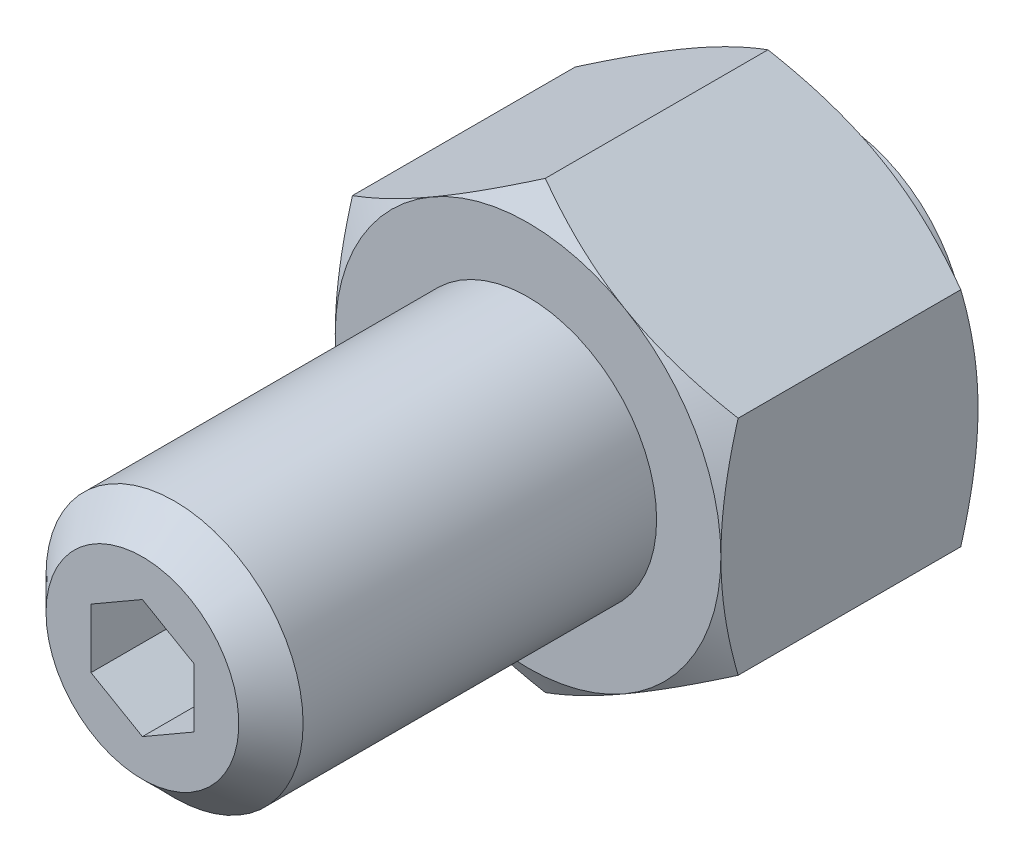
ISO-10303-21;
HEADER;
FILE_DESCRIPTION(('STEP AP214'),'2;1');
FILE_NAME('part.step','',(''),(''),'','','');
FILE_SCHEMA(('AUTOMOTIVE_DESIGN { 1 0 10303 214 1 1 1 1 }'));
ENDSEC;
DATA;
#1=APPLICATION_CONTEXT('core data for automotive mechanical design processes');
#2=APPLICATION_PROTOCOL_DEFINITION('international standard','automotive_design',2000,#1);
#3=PRODUCT_CONTEXT('',#1,'mechanical');
#4=PRODUCT('Part','Part','',(#3));
#5=PRODUCT_RELATED_PRODUCT_CATEGORY('part','',(#4));
#6=PRODUCT_DEFINITION_FORMATION('','',#4);
#7=PRODUCT_DEFINITION_CONTEXT('part definition',#1,'design');
#8=PRODUCT_DEFINITION('design','',#6,#7);
#9=PRODUCT_DEFINITION_SHAPE('','',#8);
#10=(LENGTH_UNIT() NAMED_UNIT(*) SI_UNIT(.MILLI.,.METRE.));
#11=(NAMED_UNIT(*) PLANE_ANGLE_UNIT() SI_UNIT($,.RADIAN.));
#12=(NAMED_UNIT(*) SI_UNIT($,.STERADIAN.) SOLID_ANGLE_UNIT());
#13=UNCERTAINTY_MEASURE_WITH_UNIT(LENGTH_MEASURE(1.E-05),#10,'distance_accuracy_value','');
#14=(GEOMETRIC_REPRESENTATION_CONTEXT(3) GLOBAL_UNCERTAINTY_ASSIGNED_CONTEXT((#13)) GLOBAL_UNIT_ASSIGNED_CONTEXT((#10,
#11,#12)) REPRESENTATION_CONTEXT('',''));
#15=CARTESIAN_POINT('',(0.,0.,0.));
#16=DIRECTION('',(0.,0.,1.));
#17=DIRECTION('',(1.,0.,0.));
#18=AXIS2_PLACEMENT_3D('',#15,#16,#17);
#19=CARTESIAN_POINT('',(0.,-17.3205080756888,114.));
#20=DIRECTION('',(-0.5,-0.866025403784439,0.));
#21=DIRECTION('',(-0.866025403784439,0.5,0.));
#22=AXIS2_PLACEMENT_3D('',#19,#20,#21);
#23=PLANE('',#22);
#24=DIRECTION('',(0.,0.,-1.));
#25=VECTOR('',#24,1.);
#26=CARTESIAN_POINT('',(-15.,-8.66025403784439,114.));
#27=LINE('',#26,#25);
#28=CARTESIAN_POINT('',(-15.,-8.66025403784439,22.6602540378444));
#29=VERTEX_POINT('',#28);
#30=CARTESIAN_POINT('',(-15.,-8.66025403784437,5.33974596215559));
#31=VERTEX_POINT('',#30);
#32=EDGE_CURVE('E170',#29,#31,#27,.T.);
#33=ORIENTED_EDGE('',*,*,#32,.T.);
#34=CARTESIAN_POINT('',(-15.0002,-8.66013856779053,5.33981262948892));
#35=CARTESIAN_POINT('',(-14.6705058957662,-8.85048754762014,5.2299217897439));
#36=CARTESIAN_POINT('',(-14.3395258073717,-9.04157899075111,5.12501758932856));
#37=CARTESIAN_POINT('',(-13.674911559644,-9.42529420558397,4.92656858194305));
#38=CARTESIAN_POINT('',(-13.3412765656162,-9.61791845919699,4.83302751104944));
#39=CARTESIAN_POINT('',(-12.6707077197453,-10.0050715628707,4.65856214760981));
#40=CARTESIAN_POINT('',(-12.333767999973,-10.199603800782,4.57766770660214));
#41=CARTESIAN_POINT('',(-11.6575472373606,-10.5900200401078,4.43023264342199));
#42=CARTESIAN_POINT('',(-11.3182663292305,-10.7859039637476,4.36369120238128));
#43=CARTESIAN_POINT('',(-10.6460568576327,-11.1740042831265,4.24779237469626));
#44=CARTESIAN_POINT('',(-10.3131781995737,-11.3661918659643,4.19805138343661));
#45=CARTESIAN_POINT('',(-9.64589556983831,-11.7514476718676,4.11464674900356));
#46=CARTESIAN_POINT('',(-9.31149156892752,-11.9445159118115,4.08098341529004));
#47=CARTESIAN_POINT('',(-8.64212181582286,-12.3309767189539,4.03058407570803));
#48=CARTESIAN_POINT('',(-8.30715720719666,-12.5243686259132,4.01382795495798));
#49=CARTESIAN_POINT('',(-7.63691878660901,-12.9113309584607,3.99760339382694));
#50=CARTESIAN_POINT('',(-7.30164498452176,-13.104901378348,3.99813441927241));
#51=CARTESIAN_POINT('',(-6.6748531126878,-13.4667798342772,4.01527661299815));
#52=CARTESIAN_POINT('',(-6.38329037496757,-13.6351136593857,4.02979684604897));
#53=CARTESIAN_POINT('',(-5.80083556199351,-13.971394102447,4.07163714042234));
#54=CARTESIAN_POINT('',(-5.5099435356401,-14.1393406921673,4.09895810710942));
#55=CARTESIAN_POINT('',(-4.92898814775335,-14.4747554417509,4.16592351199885));
#56=CARTESIAN_POINT('',(-4.63892567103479,-14.6422230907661,4.20557812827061));
#57=CARTESIAN_POINT('',(-4.06016058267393,-14.9763732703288,4.29651510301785));
#58=CARTESIAN_POINT('',(-3.77145806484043,-15.1430557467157,4.34779825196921));
#59=CARTESIAN_POINT('',(-2.89508556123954,-15.6490296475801,4.52038686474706));
#60=CARTESIAN_POINT('',(-2.30995340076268,-15.9868558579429,4.65890117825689));
#61=CARTESIAN_POINT('',(-1.14841408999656,-16.6574708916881,4.97327196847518));
#62=CARTESIAN_POINT('',(-0.571992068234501,-16.9902683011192,5.14905461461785));
#63=CARTESIAN_POINT('',(0.000200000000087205,-17.3206235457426,5.33981262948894));
#64=B_SPLINE_CURVE_WITH_KNOTS('',3,(#34,#35,#36,#37,#38,#39,#40,#41,#42,#43,#44,#45,#46,#47,#48,
#49,#50,#51,#52,#53,#54,#55,#56,#57,#58,#59,#60,#61,#62,#63),.UNSPECIFIED.,.F.,.F.,(4,2,2,2,2,2,
2,2,2,2,2,2,2,2,4),(0.,1.18875411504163,2.37789802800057,3.56980778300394,4.76164951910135,
5.92407379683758,7.0865204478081,8.24758247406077,9.40860862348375,10.4193068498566,
11.4300765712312,12.4416826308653,13.4533574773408,15.5211962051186,17.5849760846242),.UNSPECIFIED.);
#65=CARTESIAN_POINT('',(-7.5,-12.9903810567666,4.));
#66=VERTEX_POINT('',#65);
#67=EDGE_CURVE('E149',#31,#66,#64,.T.);
#68=ORIENTED_EDGE('',*,*,#67,.T.);
#69=CARTESIAN_POINT('',(0.,-17.3205080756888,5.33974596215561));
#70=VERTEX_POINT('',#69);
#71=EDGE_CURVE('E160',#66,#70,#64,.T.);
#72=ORIENTED_EDGE('',*,*,#71,.T.);
#73=DIRECTION('',(0.,0.,-1.));
#74=VECTOR('',#73,1.);
#75=CARTESIAN_POINT('',(0.,-17.3205080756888,114.));
#76=LINE('',#75,#74);
#77=CARTESIAN_POINT('',(0.,-17.3205080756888,22.6602540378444));
#78=VERTEX_POINT('',#77);
#79=EDGE_CURVE('E349',#78,#70,#76,.T.);
#80=ORIENTED_EDGE('',*,*,#79,.F.);
#81=CARTESIAN_POINT('',(0.000200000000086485,-17.3206235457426,22.660187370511));
#82=CARTESIAN_POINT('',(-0.329494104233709,-17.130274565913,22.770078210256));
#83=CARTESIAN_POINT('',(-0.660474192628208,-16.9391831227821,22.8749824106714));
#84=CARTESIAN_POINT('',(-1.32508844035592,-16.5554679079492,23.0734314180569));
#85=CARTESIAN_POINT('',(-1.65872343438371,-16.3628436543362,23.1669724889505));
#86=CARTESIAN_POINT('',(-2.32929228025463,-15.9756905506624,23.3414378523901));
#87=CARTESIAN_POINT('',(-2.66623200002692,-15.7811583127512,23.4223322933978));
#88=CARTESIAN_POINT('',(-3.34245276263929,-15.3907420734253,23.5697673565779));
#89=CARTESIAN_POINT('',(-3.68173367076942,-15.1948581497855,23.6363087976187));
#90=CARTESIAN_POINT('',(-4.35394314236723,-14.8067578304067,23.7522076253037));
#91=CARTESIAN_POINT('',(-4.68682180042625,-14.6145702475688,23.8019486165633));
#92=CARTESIAN_POINT('',(-5.35410443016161,-14.2293144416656,23.8853532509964));
#93=CARTESIAN_POINT('',(-5.68850843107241,-14.0362462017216,23.9190165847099));
#94=CARTESIAN_POINT('',(-6.35787818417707,-13.6497853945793,23.9694159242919));
#95=CARTESIAN_POINT('',(-6.69284279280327,-13.4563934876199,23.986172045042));
#96=CARTESIAN_POINT('',(-7.36308121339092,-13.0694311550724,24.002396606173));
#97=CARTESIAN_POINT('',(-7.69835501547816,-12.8758607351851,24.0018655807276));
#98=CARTESIAN_POINT('',(-8.32514688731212,-12.5139822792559,23.9847233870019));
#99=CARTESIAN_POINT('',(-8.61670962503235,-12.3456484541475,23.970203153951));
#100=CARTESIAN_POINT('',(-9.19916443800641,-12.0093680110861,23.9283628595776));
#101=CARTESIAN_POINT('',(-9.49005646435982,-11.8414214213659,23.9010418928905));
#102=CARTESIAN_POINT('',(-10.0710118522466,-11.5060066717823,23.8340764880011));
#103=CARTESIAN_POINT('',(-10.3610743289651,-11.338539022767,23.7944218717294));
#104=CARTESIAN_POINT('',(-10.939839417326,-11.0043888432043,23.7034848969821));
#105=CARTESIAN_POINT('',(-11.2285419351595,-10.8377063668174,23.6522017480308));
#106=CARTESIAN_POINT('',(-12.1049144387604,-10.3317324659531,23.4796131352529));
#107=CARTESIAN_POINT('',(-12.6900465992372,-9.99390625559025,23.3410988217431));
#108=CARTESIAN_POINT('',(-13.8515859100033,-9.32329122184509,23.0267280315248));
#109=CARTESIAN_POINT('',(-14.4280079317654,-8.99049381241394,22.8509453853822));
#110=CARTESIAN_POINT('',(-15.0002,-8.66013856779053,22.6601873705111));
#111=B_SPLINE_CURVE_WITH_KNOTS('',3,(#81,#82,#83,#84,#85,#86,#87,#88,#89,#90,#91,#92,#93,#94,
#95,#96,#97,#98,#99,#100,#101,#102,#103,#104,#105,#106,#107,#108,#109,#110),.UNSPECIFIED.,.F.,
.F.,(4,2,2,2,2,2,2,2,2,2,2,2,2,2,4),(0.,1.18875411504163,2.37789802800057,3.56980778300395,
4.76164951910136,5.92407379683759,7.08652044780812,8.24758247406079,9.40860862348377,
10.4193068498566,11.4300765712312,12.4416826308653,13.4533574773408,15.5211962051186,
17.5849760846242),.UNSPECIFIED.);
#112=CARTESIAN_POINT('',(-7.5,-12.9903810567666,24.));
#113=VERTEX_POINT('',#112);
#114=EDGE_CURVE('E347',#78,#113,#111,.T.);
#115=ORIENTED_EDGE('',*,*,#114,.T.);
#116=EDGE_CURVE('E235',#113,#29,#111,.T.);
#117=ORIENTED_EDGE('',*,*,#116,.T.);
#118=EDGE_LOOP('',(#33,#68,#72,#80,#115,#117));
#119=FACE_BOUND('',#118,.T.);
#120=ADVANCED_FACE('F14',(#119),#23,.T.);
#121=CARTESIAN_POINT('',(-15.,-8.66025403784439,114.));
#122=DIRECTION('',(-1.,0.,0.));
#123=DIRECTION('',(0.,0.,-1.));
#124=AXIS2_PLACEMENT_3D('',#121,#122,#123);
#125=PLANE('',#124);
#126=DIRECTION('',(0.,0.,-1.));
#127=VECTOR('',#126,1.);
#128=CARTESIAN_POINT('',(-15.,8.66025403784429,114.));
#129=LINE('',#128,#127);
#130=CARTESIAN_POINT('',(-15.,8.66025403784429,22.6602540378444));
#131=VERTEX_POINT('',#130);
#132=CARTESIAN_POINT('',(-15.,8.66025403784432,5.33974596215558));
#133=VERTEX_POINT('',#132);
#134=EDGE_CURVE('E306',#131,#133,#129,.T.);
#135=ORIENTED_EDGE('',*,*,#134,.T.);
#136=CARTESIAN_POINT('',(-15.,-23.2412806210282,11.3101052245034));
#137=CARTESIAN_POINT('',(-15.,-22.9138133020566,11.1512566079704));
#138=CARTESIAN_POINT('',(-15.,-22.5859611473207,10.993201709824));
#139=CARTESIAN_POINT('',(-15.,-21.9294068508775,10.6788591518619));
#140=CARTESIAN_POINT('',(-15.,-21.6007047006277,10.5225715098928));
#141=CARTESIAN_POINT('',(-15.,-20.6131149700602,10.0565878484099));
#142=CARTESIAN_POINT('',(-15.,-19.9528412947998,9.74981836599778));
#143=CARTESIAN_POINT('',(-15.,-18.6242648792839,9.14428629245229));
#144=CARTESIAN_POINT('',(-15.,-17.9559379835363,8.84557657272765));
#145=CARTESIAN_POINT('',(-15.,-16.6139619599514,8.26040447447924));
#146=CARTESIAN_POINT('',(-15.,-15.9403130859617,7.97394151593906));
#147=CARTESIAN_POINT('',(-15.,-14.5649325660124,7.4075730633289));
#148=CARTESIAN_POINT('',(-15.,-13.862992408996,7.12817127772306));
#149=CARTESIAN_POINT('',(-15.,-12.4508869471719,6.59056431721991));
#150=CARTESIAN_POINT('',(-15.,-11.7407207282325,6.33236152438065));
#151=CARTESIAN_POINT('',(-15.,-10.3123927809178,5.843950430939));
#152=CARTESIAN_POINT('',(-15.,-9.59425065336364,5.61368527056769));
#153=CARTESIAN_POINT('',(-15.,-8.14759670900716,5.18853963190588));
#154=CARTESIAN_POINT('',(-15.,-7.41908824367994,4.99364798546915));
#155=CARTESIAN_POINT('',(-15.,-6.32044578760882,4.73543761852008));
#156=CARTESIAN_POINT('',(-15.,-5.95425738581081,4.65522790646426));
#157=CARTESIAN_POINT('',(-15.,-5.2193824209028,4.50714101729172));
#158=CARTESIAN_POINT('',(-15.,-4.85069590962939,4.43926358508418));
#159=CARTESIAN_POINT('',(-15.,-4.1110792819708,4.3170405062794));
#160=CARTESIAN_POINT('',(-15.,-3.74014918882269,4.26269471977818));
#161=CARTESIAN_POINT('',(-15.,-2.99644308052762,4.16862035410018));
#162=CARTESIAN_POINT('',(-15.,-2.6236671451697,4.12889114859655));
#163=CARTESIAN_POINT('',(-15.,-1.88164509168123,4.06533566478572));
#164=CARTESIAN_POINT('',(-15.,-1.51241624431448,4.04130897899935));
#165=CARTESIAN_POINT('',(-15.,-0.773274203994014,4.0088899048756));
#166=CARTESIAN_POINT('',(-15.,-0.403361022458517,4.0004972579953));
#167=CARTESIAN_POINT('',(-15.,0.336489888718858,3.99954577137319));
#168=CARTESIAN_POINT('',(-15.,0.706427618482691,4.0069870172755));
#169=CARTESIAN_POINT('',(-15.,1.44566038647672,4.03752225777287));
#170=CARTESIAN_POINT('',(-15.,1.81495539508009,4.06061695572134));
#171=CARTESIAN_POINT('',(-15.,2.70314543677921,4.13449761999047));
#172=CARTESIAN_POINT('',(-15.,3.2214305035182,4.19274718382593));
#173=CARTESIAN_POINT('',(-15.,4.25414303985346,4.33690066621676));
#174=CARTESIAN_POINT('',(-15.,4.76856997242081,4.42280836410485));
#175=CARTESIAN_POINT('',(-15.,5.79308021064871,4.61922200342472));
#176=CARTESIAN_POINT('',(-15.,6.30315978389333,4.72974722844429));
#177=CARTESIAN_POINT('',(-15.,7.31819659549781,4.97202417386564));
#178=CARTESIAN_POINT('',(-15.,7.82315391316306,5.10377556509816));
#179=CARTESIAN_POINT('',(-15.,8.8390045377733,5.38840109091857));
#180=CARTESIAN_POINT('',(-15.,9.34978498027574,5.54167526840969));
#181=CARTESIAN_POINT('',(-15.,10.3663140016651,5.8640042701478));
#182=CARTESIAN_POINT('',(-15.,10.8720625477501,6.03305919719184));
#183=CARTESIAN_POINT('',(-15.,11.878778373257,6.38427041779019));
#184=CARTESIAN_POINT('',(-15.,12.3797471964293,6.56642230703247));
#185=CARTESIAN_POINT('',(-15.,13.3775377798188,6.94169002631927));
#186=CARTESIAN_POINT('',(-15.,13.8743595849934,7.13480573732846));
#187=CARTESIAN_POINT('',(-15.,15.0317338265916,7.59704209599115));
#188=CARTESIAN_POINT('',(-15.,15.6908389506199,7.86978079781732));
#189=CARTESIAN_POINT('',(-15.,17.0035532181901,8.42821537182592));
#190=CARTESIAN_POINT('',(-15.,17.6571620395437,8.71391199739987));
#191=CARTESIAN_POINT('',(-15.,18.9598860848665,9.29571112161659));
#192=CARTESIAN_POINT('',(-15.,19.6090003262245,9.59181581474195));
#193=CARTESIAN_POINT('',(-15.,20.9033330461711,10.1923673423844));
#194=CARTESIAN_POINT('',(-15.,21.5485516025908,10.4968140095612));
#195=CARTESIAN_POINT('',(-15.,22.8364059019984,11.1128382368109));
#196=CARTESIAN_POINT('',(-15.,23.4790382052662,11.4244229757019));
#197=CARTESIAN_POINT('',(-15.,24.7615480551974,12.0532099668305));
#198=CARTESIAN_POINT('',(-15.,25.4014255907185,12.3704122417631));
#199=CARTESIAN_POINT('',(-15.,26.6787645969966,13.0094457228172));
#200=CARTESIAN_POINT('',(-15.,27.3162263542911,13.3312763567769));
#201=CARTESIAN_POINT('',(-15.,28.5891566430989,13.9788577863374));
#202=CARTESIAN_POINT('',(-15.,29.2246251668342,14.3046085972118));
#203=CARTESIAN_POINT('',(-15.,31.0243937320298,15.2331159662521));
#204=CARTESIAN_POINT('',(-15.,32.1866749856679,15.8397856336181));
#205=CARTESIAN_POINT('',(-15.,34.506884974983,17.0614658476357));
#206=CARTESIAN_POINT('',(-15.,35.6648135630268,17.6764766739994));
#207=CARTESIAN_POINT('',(-15.,37.9744531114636,18.9114080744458));
#208=CARTESIAN_POINT('',(-15.,39.1261723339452,19.5313132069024));
#209=CARTESIAN_POINT('',(-15.,40.8516901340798,20.4649026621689));
#210=CARTESIAN_POINT('',(-15.,41.4265042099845,20.776712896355));
#211=CARTESIAN_POINT('',(-15.,42.5755221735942,21.4014535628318));
#212=CARTESIAN_POINT('',(-15.,43.1497260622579,21.7143839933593));
#213=CARTESIAN_POINT('',(-15.,43.7236591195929,22.0278105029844));
#214=B_SPLINE_CURVE_WITH_KNOTS('',3,(#136,#137,#138,#139,#140,#141,#142,#143,#144,#145,#146,
#147,#148,#149,#150,#151,#152,#153,#154,#155,#156,#157,#158,#159,#160,#161,#162,#163,#164,#165,
#166,#167,#168,#169,#170,#171,#172,#173,#174,#175,#176,#177,#178,#179,#180,#181,#182,#183,#184,
#185,#186,#187,#188,#189,#190,#191,#192,#193,#194,#195,#196,#197,#198,#199,#200,#201,#202,#203,
#204,#205,#206,#207,#208,#209,#210,#211,#212,#213),.UNSPECIFIED.,.F.,.F.,(4,2,2,2,2,2,2,2,2,2,2,
2,2,2,2,2,2,2,2,2,2,2,2,2,2,2,2,2,2,2,2,2,2,2,2,2,2,2,4),(0.,1.09188150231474,2.18377402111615,
4.3678832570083,6.56391936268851,8.75985134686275,11.0261000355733,13.2926030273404,
15.5544128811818,17.8155073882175,18.9399434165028,20.0643561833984,21.1887573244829,
22.3131102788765,23.4228176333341,24.5325066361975,25.6422016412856,26.7519465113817,
28.315725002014,29.8797172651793,31.4449389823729,33.0101364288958,34.6096773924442,
36.2092287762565,37.8082447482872,39.4072433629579,41.5469760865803,43.6868333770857,
45.8271445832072,47.9674128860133,50.1099373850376,52.2524705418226,54.394741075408,
56.5370199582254,60.4702260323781,64.403564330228,68.3274047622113,70.2892222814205,
72.2510367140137),.UNSPECIFIED.);
#215=CARTESIAN_POINT('',(-15.,0.,4.));
#216=VERTEX_POINT('',#215);
#217=EDGE_CURVE('E289',#133,#216,#214,.F.);
#218=ORIENTED_EDGE('',*,*,#217,.T.);
#219=EDGE_CURVE('E151',#216,#31,#214,.F.);
#220=ORIENTED_EDGE('',*,*,#219,.T.);
#221=ORIENTED_EDGE('',*,*,#32,.F.);
#222=CARTESIAN_POINT('',(-15.,-23.2412806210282,16.6898947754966));
#223=CARTESIAN_POINT('',(-15.,-22.9138133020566,16.8487433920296));
#224=CARTESIAN_POINT('',(-15.,-22.5859611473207,17.006798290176));
#225=CARTESIAN_POINT('',(-15.,-21.9294068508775,17.3211408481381));
#226=CARTESIAN_POINT('',(-15.,-21.6007047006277,17.4774284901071));
#227=CARTESIAN_POINT('',(-15.,-20.6131149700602,17.94341215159));
#228=CARTESIAN_POINT('',(-15.,-19.9528412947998,18.2501816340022));
#229=CARTESIAN_POINT('',(-15.,-18.6242648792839,18.8557137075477));
#230=CARTESIAN_POINT('',(-15.,-17.9559379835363,19.1544234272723));
#231=CARTESIAN_POINT('',(-15.,-16.6139619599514,19.7395955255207));
#232=CARTESIAN_POINT('',(-15.,-15.9403130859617,20.0260584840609));
#233=CARTESIAN_POINT('',(-15.,-14.5649325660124,20.5924269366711));
#234=CARTESIAN_POINT('',(-15.,-13.862992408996,20.8718287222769));
#235=CARTESIAN_POINT('',(-15.,-12.4508869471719,21.4094356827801));
#236=CARTESIAN_POINT('',(-15.,-11.7407207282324,21.6676384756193));
#237=CARTESIAN_POINT('',(-15.,-10.3123927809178,22.156049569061));
#238=CARTESIAN_POINT('',(-15.,-9.59425065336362,22.3863147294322));
#239=CARTESIAN_POINT('',(-15.,-8.14759670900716,22.8114603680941));
#240=CARTESIAN_POINT('',(-15.,-7.41908824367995,23.0063520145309));
#241=CARTESIAN_POINT('',(-15.,-6.32044578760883,23.2645623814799));
#242=CARTESIAN_POINT('',(-15.,-5.95425738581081,23.3447720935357));
#243=CARTESIAN_POINT('',(-15.,-5.2193824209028,23.4928589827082));
#244=CARTESIAN_POINT('',(-15.,-4.8506959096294,23.5607364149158));
#245=CARTESIAN_POINT('',(-15.,-4.11107928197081,23.6829594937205));
#246=CARTESIAN_POINT('',(-15.,-3.7401491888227,23.7373052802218));
#247=CARTESIAN_POINT('',(-15.,-2.99644308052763,23.8313796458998));
#248=CARTESIAN_POINT('',(-15.,-2.6236671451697,23.8711088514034));
#249=CARTESIAN_POINT('',(-15.,-1.88164509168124,23.9346643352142));
#250=CARTESIAN_POINT('',(-15.,-1.51241624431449,23.9586910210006));
#251=CARTESIAN_POINT('',(-15.,-0.773274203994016,23.9911100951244));
#252=CARTESIAN_POINT('',(-15.,-0.403361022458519,23.9995027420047));
#253=CARTESIAN_POINT('',(-15.,0.336489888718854,24.0004542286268));
#254=CARTESIAN_POINT('',(-15.,0.706427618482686,23.9930129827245));
#255=CARTESIAN_POINT('',(-15.,1.44566038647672,23.9624777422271));
#256=CARTESIAN_POINT('',(-15.,1.81495539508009,23.9393830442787));
#257=CARTESIAN_POINT('',(-15.,2.70314543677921,23.8655023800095));
#258=CARTESIAN_POINT('',(-15.,3.22143050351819,23.807252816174));
#259=CARTESIAN_POINT('',(-15.,4.25414303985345,23.6630993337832));
#260=CARTESIAN_POINT('',(-15.,4.7685699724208,23.5771916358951));
#261=CARTESIAN_POINT('',(-15.,5.7930802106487,23.3807779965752));
#262=CARTESIAN_POINT('',(-15.,6.30315978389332,23.2702527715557));
#263=CARTESIAN_POINT('',(-15.,7.31819659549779,23.0279758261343));
#264=CARTESIAN_POINT('',(-15.,7.82315391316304,22.8962244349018));
#265=CARTESIAN_POINT('',(-15.,8.83900453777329,22.6115989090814));
#266=CARTESIAN_POINT('',(-15.,9.34978498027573,22.4583247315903));
#267=CARTESIAN_POINT('',(-15.,10.3663140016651,22.1359957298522));
#268=CARTESIAN_POINT('',(-15.,10.87206254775,21.9669408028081));
#269=CARTESIAN_POINT('',(-15.,11.878778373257,21.6157295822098));
#270=CARTESIAN_POINT('',(-15.,12.3797471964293,21.4335776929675));
#271=CARTESIAN_POINT('',(-15.,13.3775377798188,21.0583099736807));
#272=CARTESIAN_POINT('',(-15.,13.8743595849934,20.8651942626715));
#273=CARTESIAN_POINT('',(-15.,15.0317338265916,20.4029579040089));
#274=CARTESIAN_POINT('',(-15.,15.6908389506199,20.1302192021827));
#275=CARTESIAN_POINT('',(-15.,17.00355321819,19.571784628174));
#276=CARTESIAN_POINT('',(-15.,17.6571620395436,19.2860880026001));
#277=CARTESIAN_POINT('',(-15.,18.9598860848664,18.7042888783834));
#278=CARTESIAN_POINT('',(-15.,19.6090003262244,18.408184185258));
#279=CARTESIAN_POINT('',(-15.,20.903333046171,17.8076326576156));
#280=CARTESIAN_POINT('',(-15.,21.5485516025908,17.5031859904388));
#281=CARTESIAN_POINT('',(-15.,22.8364059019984,16.8871617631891));
#282=CARTESIAN_POINT('',(-15.,23.4790382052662,16.5755770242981));
#283=CARTESIAN_POINT('',(-15.,24.7615480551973,15.9467900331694));
#284=CARTESIAN_POINT('',(-15.,25.4014255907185,15.6295877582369));
#285=CARTESIAN_POINT('',(-15.,26.6787645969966,14.9905542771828));
#286=CARTESIAN_POINT('',(-15.,27.3162263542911,14.6687236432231));
#287=CARTESIAN_POINT('',(-15.,28.5891566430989,14.0211422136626));
#288=CARTESIAN_POINT('',(-15.,29.2246251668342,13.6953914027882));
#289=CARTESIAN_POINT('',(-15.,31.0243937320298,12.7668840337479));
#290=CARTESIAN_POINT('',(-15.,32.1866749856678,12.1602143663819));
#291=CARTESIAN_POINT('',(-15.,34.506884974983,10.9385341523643));
#292=CARTESIAN_POINT('',(-15.,35.6648135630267,10.3235233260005));
#293=CARTESIAN_POINT('',(-15.,37.9744531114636,9.08859192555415));
#294=CARTESIAN_POINT('',(-15.,39.1261723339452,8.4686867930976));
#295=CARTESIAN_POINT('',(-15.,40.8516901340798,7.53509733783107));
#296=CARTESIAN_POINT('',(-15.,41.4265042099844,7.22328710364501));
#297=CARTESIAN_POINT('',(-15.,42.5755221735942,6.59854643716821));
#298=CARTESIAN_POINT('',(-15.,43.1497260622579,6.2856160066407));
#299=CARTESIAN_POINT('',(-15.,43.7236591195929,5.97218949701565));
#300=B_SPLINE_CURVE_WITH_KNOTS('',3,(#222,#223,#224,#225,#226,#227,#228,#229,#230,#231,#232,
#233,#234,#235,#236,#237,#238,#239,#240,#241,#242,#243,#244,#245,#246,#247,#248,#249,#250,#251,
#252,#253,#254,#255,#256,#257,#258,#259,#260,#261,#262,#263,#264,#265,#266,#267,#268,#269,#270,
#271,#272,#273,#274,#275,#276,#277,#278,#279,#280,#281,#282,#283,#284,#285,#286,#287,#288,#289,
#290,#291,#292,#293,#294,#295,#296,#297,#298,#299),.UNSPECIFIED.,.F.,.F.,(4,2,2,2,2,2,2,2,2,2,2,
2,2,2,2,2,2,2,2,2,2,2,2,2,2,2,2,2,2,2,2,2,2,2,2,2,2,2,4),(0.,1.09188150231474,2.18377402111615,
4.3678832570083,6.56391936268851,8.75985134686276,11.0261000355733,13.2926030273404,
15.5544128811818,17.8155073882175,18.9399434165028,20.0643561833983,21.1887573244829,
22.3131102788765,23.4228176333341,24.5325066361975,25.6422016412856,26.7519465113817,
28.3157250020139,29.8797172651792,31.4449389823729,33.0101364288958,34.6096773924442,
36.2092287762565,37.8082447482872,39.4072433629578,41.5469760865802,43.6868333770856,
45.8271445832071,47.9674128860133,50.1099373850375,52.2524705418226,54.3947410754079,
56.5370199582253,60.4702260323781,64.4035643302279,68.3274047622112,70.2892222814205,
72.2510367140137),.UNSPECIFIED.);
#301=CARTESIAN_POINT('',(-15.,0.,24.));
#302=VERTEX_POINT('',#301);
#303=EDGE_CURVE('E245',#29,#302,#300,.T.);
#304=ORIENTED_EDGE('',*,*,#303,.T.);
#305=EDGE_CURVE('E265',#302,#131,#300,.T.);
#306=ORIENTED_EDGE('',*,*,#305,.T.);
#307=EDGE_LOOP('',(#135,#218,#220,#221,#304,#306));
#308=FACE_BOUND('',#307,.T.);
#309=ADVANCED_FACE('F269',(#308),#125,.T.);
#310=CARTESIAN_POINT('',(0.,17.3205080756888,114.));
#311=DIRECTION('',(0.500000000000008,-0.866025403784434,0.));
#312=DIRECTION('',(-0.866025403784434,-0.500000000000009,0.));
#313=AXIS2_PLACEMENT_3D('',#310,#311,#312);
#314=PLANE('',#313);
#315=CARTESIAN_POINT('',(-15.0002,8.66013856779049,5.33981262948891));
#316=CARTESIAN_POINT('',(-14.6705058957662,8.85048754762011,5.22992178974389));
#317=CARTESIAN_POINT('',(-14.3395258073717,9.04157899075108,5.12501758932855));
#318=CARTESIAN_POINT('',(-13.674911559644,9.42529420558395,4.92656858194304));
#319=CARTESIAN_POINT('',(-13.3412765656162,9.61791845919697,4.83302751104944));
#320=CARTESIAN_POINT('',(-12.6707077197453,10.0050715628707,4.65856214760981));
#321=CARTESIAN_POINT('',(-12.333767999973,10.1996038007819,4.57766770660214));
#322=CARTESIAN_POINT('',(-11.6575472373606,10.5900200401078,4.430232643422));
#323=CARTESIAN_POINT('',(-11.3182663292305,10.7859039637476,4.36369120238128));
#324=CARTESIAN_POINT('',(-10.6460568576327,11.1740042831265,4.24779237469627));
#325=CARTESIAN_POINT('',(-10.3131781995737,11.3661918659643,4.19805138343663));
#326=CARTESIAN_POINT('',(-9.64589556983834,11.7514476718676,4.11464674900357));
#327=CARTESIAN_POINT('',(-9.31149156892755,11.9445159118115,4.08098341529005));
#328=CARTESIAN_POINT('',(-8.64212181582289,12.3309767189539,4.03058407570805));
#329=CARTESIAN_POINT('',(-8.30715720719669,12.5243686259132,4.01382795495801));
#330=CARTESIAN_POINT('',(-7.63691878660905,12.9113309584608,3.99760339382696));
#331=CARTESIAN_POINT('',(-7.30164498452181,13.1049013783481,3.99813441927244));
#332=CARTESIAN_POINT('',(-6.67485311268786,13.4667798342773,4.01527661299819));
#333=CARTESIAN_POINT('',(-6.38329037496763,13.6351136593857,4.029796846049));
#334=CARTESIAN_POINT('',(-5.80083556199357,13.9713941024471,4.07163714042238));
#335=CARTESIAN_POINT('',(-5.50994353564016,14.1393406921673,4.09895810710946));
#336=CARTESIAN_POINT('',(-4.92898814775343,14.4747554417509,4.16592351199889));
#337=CARTESIAN_POINT('',(-4.63892567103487,14.6422230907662,4.20557812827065));
#338=CARTESIAN_POINT('',(-4.06016058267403,14.9763732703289,4.29651510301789));
#339=CARTESIAN_POINT('',(-3.77145806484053,15.1430557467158,4.34779825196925));
#340=CARTESIAN_POINT('',(-2.89508556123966,15.6490296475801,4.5203868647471));
#341=CARTESIAN_POINT('',(-2.30995340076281,15.986855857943,4.65890117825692));
#342=CARTESIAN_POINT('',(-1.14841408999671,16.6574708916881,4.97327196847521));
#343=CARTESIAN_POINT('',(-0.571992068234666,16.9902683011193,5.14905461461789));
#344=CARTESIAN_POINT('',(0.000199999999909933,17.3206235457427,5.33981262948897));
#345=B_SPLINE_CURVE_WITH_KNOTS('',3,(#315,#316,#317,#318,#319,#320,#321,#322,#323,#324,#325,
#326,#327,#328,#329,#330,#331,#332,#333,#334,#335,#336,#337,#338,#339,#340,#341,#342,#343,#344),
.UNSPECIFIED.,.F.,.F.,(4,2,2,2,2,2,2,2,2,2,2,2,2,2,4),(0.,1.18875411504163,2.37789802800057,
3.56980778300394,4.76164951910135,5.92407379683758,7.0865204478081,8.24758247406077,
9.40860862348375,10.4193068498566,11.4300765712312,12.4416826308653,13.4533574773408,
15.5211962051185,17.5849760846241),.UNSPECIFIED.);
#346=CARTESIAN_POINT('',(-7.50000000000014,12.9903810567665,4.));
#347=VERTEX_POINT('',#346);
#348=EDGE_CURVE('E280',#133,#347,#345,.T.);
#349=ORIENTED_EDGE('',*,*,#348,.F.);
#350=ORIENTED_EDGE('',*,*,#134,.F.);
#351=CARTESIAN_POINT('',(0.000199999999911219,17.3206235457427,22.660187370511));
#352=CARTESIAN_POINT('',(-0.329494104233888,17.1302745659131,22.770078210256));
#353=CARTESIAN_POINT('',(-0.660474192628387,16.9391831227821,22.8749824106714));
#354=CARTESIAN_POINT('',(-1.3250884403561,16.5554679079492,23.0734314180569));
#355=CARTESIAN_POINT('',(-1.65872343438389,16.3628436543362,23.1669724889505));
#356=CARTESIAN_POINT('',(-2.32929228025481,15.9756905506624,23.3414378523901));
#357=CARTESIAN_POINT('',(-2.66623200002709,15.7811583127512,23.4223322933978));
#358=CARTESIAN_POINT('',(-3.34245276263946,15.3907420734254,23.5697673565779));
#359=CARTESIAN_POINT('',(-3.68173367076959,15.1948581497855,23.6363087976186));
#360=CARTESIAN_POINT('',(-4.35394314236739,14.8067578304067,23.7522076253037));
#361=CARTESIAN_POINT('',(-4.68682180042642,14.6145702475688,23.8019486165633));
#362=CARTESIAN_POINT('',(-5.35410443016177,14.2293144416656,23.8853532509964));
#363=CARTESIAN_POINT('',(-5.68850843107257,14.0362462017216,23.9190165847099));
#364=CARTESIAN_POINT('',(-6.35787818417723,13.6497853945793,23.9694159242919));
#365=CARTESIAN_POINT('',(-6.69284279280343,13.4563934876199,23.9861720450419));
#366=CARTESIAN_POINT('',(-7.36308121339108,13.0694311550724,24.002396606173));
#367=CARTESIAN_POINT('',(-7.69835501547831,12.8758607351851,24.0018655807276));
#368=CARTESIAN_POINT('',(-8.32514688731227,12.5139822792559,23.9847233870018));
#369=CARTESIAN_POINT('',(-8.6167096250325,12.3456484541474,23.970203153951));
#370=CARTESIAN_POINT('',(-9.19916443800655,12.0093680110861,23.9283628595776));
#371=CARTESIAN_POINT('',(-9.49005646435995,11.8414214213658,23.9010418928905));
#372=CARTESIAN_POINT('',(-10.0710118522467,11.5060066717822,23.8340764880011));
#373=CARTESIAN_POINT('',(-10.3610743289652,11.338539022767,23.7944218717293));
#374=CARTESIAN_POINT('',(-10.9398394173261,11.0043888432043,23.7034848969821));
#375=CARTESIAN_POINT('',(-11.2285419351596,10.8377063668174,23.6522017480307));
#376=CARTESIAN_POINT('',(-12.1049144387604,10.331732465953,23.4796131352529));
#377=CARTESIAN_POINT('',(-12.6900465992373,9.99390625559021,23.3410988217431));
#378=CARTESIAN_POINT('',(-13.8515859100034,9.32329122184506,23.0267280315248));
#379=CARTESIAN_POINT('',(-14.4280079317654,8.9904938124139,22.8509453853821));
#380=CARTESIAN_POINT('',(-15.0002,8.66013856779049,22.6601873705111));
#381=B_SPLINE_CURVE_WITH_KNOTS('',3,(#351,#352,#353,#354,#355,#356,#357,#358,#359,#360,#361,
#362,#363,#364,#365,#366,#367,#368,#369,#370,#371,#372,#373,#374,#375,#376,#377,#378,#379,#380),
.UNSPECIFIED.,.F.,.F.,(4,2,2,2,2,2,2,2,2,2,2,2,2,2,4),(0.,1.18875411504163,2.37789802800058,
3.56980778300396,4.76164951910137,5.9240737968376,7.08652044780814,8.24758247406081,
9.4086086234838,10.4193068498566,11.4300765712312,12.4416826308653,13.4533574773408,
15.5211962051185,17.584976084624),.UNSPECIFIED.);
#382=CARTESIAN_POINT('',(-7.50000000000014,12.9903810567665,24.));
#383=VERTEX_POINT('',#382);
#384=EDGE_CURVE('E259',#383,#131,#381,.T.);
#385=ORIENTED_EDGE('',*,*,#384,.F.);
#386=CARTESIAN_POINT('',(0.,17.3205080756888,22.6602540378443));
#387=VERTEX_POINT('',#386);
#388=EDGE_CURVE('E264',#387,#383,#381,.T.);
#389=ORIENTED_EDGE('',*,*,#388,.F.);
#390=DIRECTION('',(0.,0.,-1.));
#391=VECTOR('',#390,1.);
#392=CARTESIAN_POINT('',(0.,17.3205080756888,114.));
#393=LINE('',#392,#391);
#394=CARTESIAN_POINT('',(0.,17.3205080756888,5.33974596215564));
#395=VERTEX_POINT('',#394);
#396=EDGE_CURVE('E314',#387,#395,#393,.T.);
#397=ORIENTED_EDGE('',*,*,#396,.T.);
#398=EDGE_CURVE('E274',#347,#395,#345,.T.);
#399=ORIENTED_EDGE('',*,*,#398,.F.);
#400=EDGE_LOOP('',(#349,#350,#385,#389,#397,#399));
#401=FACE_BOUND('',#400,.T.);
#402=ADVANCED_FACE('F266',(#401),#314,.F.);
#403=CARTESIAN_POINT('',(0.,17.3205080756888,114.));
#404=DIRECTION('',(0.5,0.866025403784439,0.));
#405=DIRECTION('',(0.866025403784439,-0.5,0.));
#406=AXIS2_PLACEMENT_3D('',#403,#404,#405);
#407=PLANE('',#406);
#408=DIRECTION('',(0.,0.,-1.));
#409=VECTOR('',#408,1.);
#410=CARTESIAN_POINT('',(15.,8.6602540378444,114.));
#411=LINE('',#410,#409);
#412=CARTESIAN_POINT('',(15.,8.66025403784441,22.6602540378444));
#413=VERTEX_POINT('',#412);
#414=CARTESIAN_POINT('',(15.,8.6602540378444,5.3397459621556));
#415=VERTEX_POINT('',#414);
#416=EDGE_CURVE('E326',#413,#415,#411,.T.);
#417=ORIENTED_EDGE('',*,*,#416,.T.);
#418=CARTESIAN_POINT('',(15.0002,8.66013856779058,5.33981262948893));
#419=CARTESIAN_POINT('',(14.6705058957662,8.85048754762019,5.22992178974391));
#420=CARTESIAN_POINT('',(14.3395258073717,9.04157899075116,5.12501758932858));
#421=CARTESIAN_POINT('',(13.674911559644,9.42529420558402,4.92656858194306));
#422=CARTESIAN_POINT('',(13.3412765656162,9.61791845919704,4.83302751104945));
#423=CARTESIAN_POINT('',(12.6707077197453,10.0050715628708,4.65856214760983));
#424=CARTESIAN_POINT('',(12.333767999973,10.199603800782,4.57766770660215));
#425=CARTESIAN_POINT('',(11.6575472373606,10.5900200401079,4.43023264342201));
#426=CARTESIAN_POINT('',(11.3182663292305,10.7859039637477,4.36369120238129));
#427=CARTESIAN_POINT('',(10.6460568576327,11.1740042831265,4.24779237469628));
#428=CARTESIAN_POINT('',(10.3131781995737,11.3661918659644,4.19805138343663));
#429=CARTESIAN_POINT('',(9.64589556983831,11.7514476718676,4.11464674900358));
#430=CARTESIAN_POINT('',(9.31149156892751,11.9445159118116,4.08098341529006));
#431=CARTESIAN_POINT('',(8.64212181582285,12.3309767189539,4.03058407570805));
#432=CARTESIAN_POINT('',(8.30715720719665,12.5243686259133,4.01382795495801));
#433=CARTESIAN_POINT('',(7.63691878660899,12.9113309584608,3.99760339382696));
#434=CARTESIAN_POINT('',(7.30164498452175,13.1049013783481,3.99813441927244));
#435=CARTESIAN_POINT('',(6.67485311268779,13.4667798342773,4.01527661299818));
#436=CARTESIAN_POINT('',(6.38329037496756,13.6351136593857,4.02979684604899));
#437=CARTESIAN_POINT('',(5.8008355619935,13.9713941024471,4.07163714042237));
#438=CARTESIAN_POINT('',(5.50994353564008,14.1393406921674,4.09895810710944));
#439=CARTESIAN_POINT('',(4.92898814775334,14.4747554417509,4.16592351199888));
#440=CARTESIAN_POINT('',(4.63892567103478,14.6422230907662,4.20557812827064));
#441=CARTESIAN_POINT('',(4.06016058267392,14.9763732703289,4.29651510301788));
#442=CARTESIAN_POINT('',(3.77145806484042,15.1430557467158,4.34779825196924));
#443=CARTESIAN_POINT('',(2.89508556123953,15.6490296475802,4.52038686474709));
#444=CARTESIAN_POINT('',(2.30995340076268,15.986855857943,4.65890117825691));
#445=CARTESIAN_POINT('',(1.14841408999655,16.6574708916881,4.97327196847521));
#446=CARTESIAN_POINT('',(0.571992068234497,16.9902683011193,5.14905461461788));
#447=CARTESIAN_POINT('',(-0.000200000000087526,17.3206235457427,5.33981262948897));
#448=B_SPLINE_CURVE_WITH_KNOTS('',3,(#418,#419,#420,#421,#422,#423,#424,#425,#426,#427,#428,
#429,#430,#431,#432,#433,#434,#435,#436,#437,#438,#439,#440,#441,#442,#443,#444,#445,#446,#447),
.UNSPECIFIED.,.F.,.F.,(4,2,2,2,2,2,2,2,2,2,2,2,2,2,4),(0.,1.18875411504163,2.37789802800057,
3.56980778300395,4.76164951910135,5.92407379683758,7.08652044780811,8.24758247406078,
9.40860862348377,10.4193068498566,11.4300765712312,12.4416826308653,13.4533574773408,
15.5211962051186,17.5849760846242),.UNSPECIFIED.);
#449=CARTESIAN_POINT('',(7.5,12.9903810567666,4.));
#450=VERTEX_POINT('',#449);
#451=EDGE_CURVE('E165',#415,#450,#448,.T.);
#452=ORIENTED_EDGE('',*,*,#451,.T.);
#453=EDGE_CURVE('E171',#450,#395,#448,.T.);
#454=ORIENTED_EDGE('',*,*,#453,.T.);
#455=ORIENTED_EDGE('',*,*,#396,.F.);
#456=CARTESIAN_POINT('',(-0.000200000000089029,17.3206235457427,22.660187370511));
#457=CARTESIAN_POINT('',(0.329494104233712,17.1302745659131,22.770078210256));
#458=CARTESIAN_POINT('',(0.660474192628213,16.9391831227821,22.8749824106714));
#459=CARTESIAN_POINT('',(1.32508844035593,16.5554679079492,23.0734314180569));
#460=CARTESIAN_POINT('',(1.65872343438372,16.3628436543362,23.1669724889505));
#461=CARTESIAN_POINT('',(2.32929228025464,15.9756905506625,23.3414378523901));
#462=CARTESIAN_POINT('',(2.66623200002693,15.7811583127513,23.4223322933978));
#463=CARTESIAN_POINT('',(3.34245276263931,15.3907420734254,23.5697673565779));
#464=CARTESIAN_POINT('',(3.68173367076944,15.1948581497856,23.6363087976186));
#465=CARTESIAN_POINT('',(4.35394314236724,14.8067578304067,23.7522076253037));
#466=CARTESIAN_POINT('',(4.68682180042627,14.6145702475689,23.8019486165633));
#467=CARTESIAN_POINT('',(5.35410443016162,14.2293144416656,23.8853532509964));
#468=CARTESIAN_POINT('',(5.68850843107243,14.0362462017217,23.9190165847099));
#469=CARTESIAN_POINT('',(6.35787818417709,13.6497853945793,23.9694159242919));
#470=CARTESIAN_POINT('',(6.69284279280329,13.45639348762,23.9861720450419));
#471=CARTESIAN_POINT('',(7.36308121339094,13.0694311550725,24.002396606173));
#472=CARTESIAN_POINT('',(7.69835501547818,12.8758607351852,24.0018655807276));
#473=CARTESIAN_POINT('',(8.32514688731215,12.513982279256,23.9847233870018));
#474=CARTESIAN_POINT('',(8.61670962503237,12.3456484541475,23.970203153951));
#475=CARTESIAN_POINT('',(9.19916443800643,12.0093680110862,23.9283628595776));
#476=CARTESIAN_POINT('',(9.49005646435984,11.8414214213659,23.9010418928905));
#477=CARTESIAN_POINT('',(10.0710118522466,11.5060066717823,23.8340764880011));
#478=CARTESIAN_POINT('',(10.3610743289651,11.3385390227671,23.7944218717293));
#479=CARTESIAN_POINT('',(10.939839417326,11.0043888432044,23.7034848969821));
#480=CARTESIAN_POINT('',(11.2285419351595,10.8377063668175,23.6522017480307));
#481=CARTESIAN_POINT('',(12.1049144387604,10.3317324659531,23.4796131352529));
#482=CARTESIAN_POINT('',(12.6900465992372,9.99390625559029,23.3410988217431));
#483=CARTESIAN_POINT('',(13.8515859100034,9.32329122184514,23.0267280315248));
#484=CARTESIAN_POINT('',(14.4280079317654,8.99049381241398,22.8509453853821));
#485=CARTESIAN_POINT('',(15.0002,8.66013856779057,22.660187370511));
#486=B_SPLINE_CURVE_WITH_KNOTS('',3,(#456,#457,#458,#459,#460,#461,#462,#463,#464,#465,#466,
#467,#468,#469,#470,#471,#472,#473,#474,#475,#476,#477,#478,#479,#480,#481,#482,#483,#484,#485),
.UNSPECIFIED.,.F.,.F.,(4,2,2,2,2,2,2,2,2,2,2,2,2,2,4),(0.,1.18875411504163,2.37789802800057,
3.56980778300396,4.76164951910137,5.92407379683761,7.08652044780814,8.24758247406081,
9.4086086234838,10.4193068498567,11.4300765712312,12.4416826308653,13.4533574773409,
15.5211962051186,17.5849760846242),.UNSPECIFIED.);
#487=CARTESIAN_POINT('',(7.5,12.9903810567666,24.));
#488=VERTEX_POINT('',#487);
#489=EDGE_CURVE('E215',#387,#488,#486,.T.);
#490=ORIENTED_EDGE('',*,*,#489,.T.);
#491=EDGE_CURVE('E214',#488,#413,#486,.T.);
#492=ORIENTED_EDGE('',*,*,#491,.T.);
#493=EDGE_LOOP('',(#417,#452,#454,#455,#490,#492));
#494=FACE_BOUND('',#493,.T.);
#495=ADVANCED_FACE('F199',(#494),#407,.T.);
#496=CARTESIAN_POINT('',(15.,-8.66025403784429,114.));
#497=DIRECTION('',(-1.,0.,0.));
#498=DIRECTION('',(0.,1.,0.));
#499=AXIS2_PLACEMENT_3D('',#496,#497,#498);
#500=PLANE('',#499);
#501=CARTESIAN_POINT('',(15.,-23.241280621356,11.3101052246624));
#502=CARTESIAN_POINT('',(15.,-22.9138133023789,11.1512566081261));
#503=CARTESIAN_POINT('',(15.,-22.5859611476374,10.9932017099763));
#504=CARTESIAN_POINT('',(15.,-21.9294068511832,10.6788591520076));
#505=CARTESIAN_POINT('',(15.,-21.600704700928,10.5225715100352));
#506=CARTESIAN_POINT('',(15.,-20.6131149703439,10.0565878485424));
#507=CARTESIAN_POINT('',(15.,-19.9528412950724,9.74981836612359));
#508=CARTESIAN_POINT('',(15.,-18.6242648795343,9.14428629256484));
#509=CARTESIAN_POINT('',(15.,-17.9559379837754,8.84557657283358));
#510=CARTESIAN_POINT('',(15.,-16.613961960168,8.26040447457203));
#511=CARTESIAN_POINT('',(15.,-15.940313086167,7.97394151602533));
#512=CARTESIAN_POINT('',(15.,-14.5649325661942,7.40757306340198));
#513=CARTESIAN_POINT('',(15.,-13.8629924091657,7.12817127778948));
#514=CARTESIAN_POINT('',(15.,-12.4508869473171,6.59056431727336));
#515=CARTESIAN_POINT('',(15.,-11.7407207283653,6.3323615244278));
#516=CARTESIAN_POINT('',(15.,-10.3123927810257,5.84395043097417));
#517=CARTESIAN_POINT('',(15.,-9.59425065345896,5.61368527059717));
#518=CARTESIAN_POINT('',(15.,-8.14759670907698,5.18853963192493));
#519=CARTESIAN_POINT('',(15.,-7.41908824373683,4.99364798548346));
#520=CARTESIAN_POINT('',(15.,-6.32044578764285,4.73543761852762));
#521=CARTESIAN_POINT('',(15.,-5.95425738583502,4.6552279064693));
#522=CARTESIAN_POINT('',(15.,-5.21938242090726,4.50714101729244));
#523=CARTESIAN_POINT('',(15.,-4.8506959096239,4.43926358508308));
#524=CARTESIAN_POINT('',(15.,-4.11107928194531,4.31704050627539));
#525=CARTESIAN_POINT('',(15.,-3.74014918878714,4.26269471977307));
#526=CARTESIAN_POINT('',(15.,-2.99644308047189,4.16862035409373));
#527=CARTESIAN_POINT('',(15.,-2.62366714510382,4.12889114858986));
#528=CARTESIAN_POINT('',(15.,-1.8816450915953,4.0653356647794));
#529=CARTESIAN_POINT('',(15.,-1.51241624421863,4.04130897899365));
#530=CARTESIAN_POINT('',(15.,-0.773274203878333,4.00888990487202));
#531=CARTESIAN_POINT('',(15.,-0.403361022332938,4.00049725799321));
#532=CARTESIAN_POINT('',(15.,0.336489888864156,3.99954577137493));
#533=CARTESIAN_POINT('',(15.,0.706427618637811,4.00698701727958));
#534=CARTESIAN_POINT('',(15.,1.44566038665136,4.03752225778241));
#535=CARTESIAN_POINT('',(15.,1.81495539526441,4.060616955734));
#536=CARTESIAN_POINT('',(15.,2.70314543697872,4.13449762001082));
#537=CARTESIAN_POINT('',(15.,3.22143050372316,4.19274718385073));
#538=CARTESIAN_POINT('',(15.,4.25414304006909,4.33690066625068));
#539=CARTESIAN_POINT('',(15.,4.76856997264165,4.42280836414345));
#540=CARTESIAN_POINT('',(15.,5.79308021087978,4.61922200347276));
#541=CARTESIAN_POINT('',(15.,6.30315978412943,4.72974722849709));
#542=CARTESIAN_POINT('',(15.,7.31819659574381,4.97202417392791));
#543=CARTESIAN_POINT('',(15.,7.82315391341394,5.10377556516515));
#544=CARTESIAN_POINT('',(15.,8.83900453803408,5.38840109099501));
#545=CARTESIAN_POINT('',(15.,9.34978498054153,5.54167526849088));
#546=CARTESIAN_POINT('',(15.,10.3663140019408,5.86400427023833));
#547=CARTESIAN_POINT('',(15.,10.8720625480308,6.03305919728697));
#548=CARTESIAN_POINT('',(15.,11.8787783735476,6.38427041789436));
#549=CARTESIAN_POINT('',(15.,12.3797471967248,6.56642230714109));
#550=CARTESIAN_POINT('',(15.,13.3775377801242,6.94169002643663));
#551=CARTESIAN_POINT('',(15.,13.8743595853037,7.13480573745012));
#552=CARTESIAN_POINT('',(15.,15.0317338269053,7.59704209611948));
#553=CARTESIAN_POINT('',(15.,15.6908389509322,7.86978079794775));
#554=CARTESIAN_POINT('',(15.,17.0035532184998,8.4282153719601));
#555=CARTESIAN_POINT('',(15.,17.6571620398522,8.71391199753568));
#556=CARTESIAN_POINT('',(15.,18.9598860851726,9.29571112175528));
#557=CARTESIAN_POINT('',(15.,19.6090003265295,9.59181581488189));
#558=CARTESIAN_POINT('',(15.,20.903333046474,10.1923673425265));
#559=CARTESIAN_POINT('',(15.,21.5485516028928,10.4968140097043));
#560=CARTESIAN_POINT('',(15.,22.8364059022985,11.1128382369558));
#561=CARTESIAN_POINT('',(15.,23.4790382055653,11.4244229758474));
#562=CARTESIAN_POINT('',(15.,24.7615480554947,12.0532099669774));
#563=CARTESIAN_POINT('',(15.,25.401425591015,12.3704122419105));
#564=CARTESIAN_POINT('',(15.,26.6787645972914,13.0094457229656));
#565=CARTESIAN_POINT('',(15.,27.3162263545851,13.3312763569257));
#566=CARTESIAN_POINT('',(15.,28.5891566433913,13.978857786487));
#567=CARTESIAN_POINT('',(15.,29.2246251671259,14.3046085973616));
#568=CARTESIAN_POINT('',(15.,31.0243937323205,15.2331159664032));
#569=CARTESIAN_POINT('',(15.,32.1866749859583,15.8397856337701));
#570=CARTESIAN_POINT('',(15.,34.506884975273,17.0614658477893));
#571=CARTESIAN_POINT('',(15.,35.6648135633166,17.6764766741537));
#572=CARTESIAN_POINT('',(15.,37.9744531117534,18.9114080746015));
#573=CARTESIAN_POINT('',(15.,39.1261723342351,19.5313132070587));
#574=CARTESIAN_POINT('',(15.,40.8516901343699,20.4649026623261));
#575=CARTESIAN_POINT('',(15.,41.4265042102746,20.7767128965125));
#576=CARTESIAN_POINT('',(15.,42.5755221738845,21.4014535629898));
#577=CARTESIAN_POINT('',(15.,43.1497260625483,21.7143839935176));
#578=CARTESIAN_POINT('',(15.,43.7236591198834,22.027810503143));
#579=B_SPLINE_CURVE_WITH_KNOTS('',3,(#501,#502,#503,#504,#505,#506,#507,#508,#509,#510,#511,
#512,#513,#514,#515,#516,#517,#518,#519,#520,#521,#522,#523,#524,#525,#526,#527,#528,#529,#530,
#531,#532,#533,#534,#535,#536,#537,#538,#539,#540,#541,#542,#543,#544,#545,#546,#547,#548,#549,
#550,#551,#552,#553,#554,#555,#556,#557,#558,#559,#560,#561,#562,#563,#564,#565,#566,#567,#568,
#569,#570,#571,#572,#573,#574,#575,#576,#577,#578),.UNSPECIFIED.,.F.,.F.,(4,2,2,2,2,2,2,2,2,2,2,
2,2,2,2,2,2,2,2,2,2,2,2,2,2,2,2,2,2,2,2,2,2,2,2,2,2,2,4),(0.,1.09188150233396,2.18377402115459,
4.36788325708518,6.56391936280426,8.75985134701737,11.0261000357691,13.2926030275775,
15.5544128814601,17.8155073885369,18.9399434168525,20.0643561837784,21.1887573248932,
22.3131102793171,23.4228176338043,24.5325066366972,25.6422016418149,26.7519465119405,
28.3157250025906,29.8797172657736,31.444938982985,33.0101364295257,34.6096773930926,
36.2092287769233,37.8082447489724,39.4072433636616,41.5469760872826,43.6868333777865,
45.8271445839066,47.9674128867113,50.109937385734,52.2524705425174,54.3947410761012,
56.537019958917,60.4702260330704,64.4035643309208,68.3274047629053,70.2892222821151,
72.2510367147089),.UNSPECIFIED.);
#580=CARTESIAN_POINT('',(15.,0.,4.));
#581=VERTEX_POINT('',#580);
#582=EDGE_CURVE('E185',#415,#581,#579,.F.);
#583=ORIENTED_EDGE('',*,*,#582,.F.);
#584=ORIENTED_EDGE('',*,*,#416,.F.);
#585=CARTESIAN_POINT('',(15.,-23.241280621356,16.6898947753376));
#586=CARTESIAN_POINT('',(15.,-22.9138133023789,16.8487433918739));
#587=CARTESIAN_POINT('',(15.,-22.5859611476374,17.0067982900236));
#588=CARTESIAN_POINT('',(15.,-21.9294068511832,17.3211408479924));
#589=CARTESIAN_POINT('',(15.,-21.6007047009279,17.4774284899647));
#590=CARTESIAN_POINT('',(15.,-20.6131149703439,17.9434121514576));
#591=CARTESIAN_POINT('',(15.,-19.9528412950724,18.2501816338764));
#592=CARTESIAN_POINT('',(15.,-18.6242648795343,18.8557137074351));
#593=CARTESIAN_POINT('',(15.,-17.9559379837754,19.1544234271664));
#594=CARTESIAN_POINT('',(15.,-16.613961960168,19.7395955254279));
#595=CARTESIAN_POINT('',(15.,-15.9403130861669,20.0260584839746));
#596=CARTESIAN_POINT('',(15.,-14.5649325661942,20.592426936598));
#597=CARTESIAN_POINT('',(15.,-13.8629924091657,20.8718287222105));
#598=CARTESIAN_POINT('',(15.,-12.4508869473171,21.4094356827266));
#599=CARTESIAN_POINT('',(15.,-11.7407207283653,21.6676384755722));
#600=CARTESIAN_POINT('',(15.,-10.3123927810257,22.1560495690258));
#601=CARTESIAN_POINT('',(15.,-9.59425065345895,22.3863147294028));
#602=CARTESIAN_POINT('',(15.,-8.14759670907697,22.811460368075));
#603=CARTESIAN_POINT('',(15.,-7.41908824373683,23.0063520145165));
#604=CARTESIAN_POINT('',(15.,-6.32044578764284,23.2645623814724));
#605=CARTESIAN_POINT('',(15.,-5.95425738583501,23.3447720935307));
#606=CARTESIAN_POINT('',(15.,-5.21938242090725,23.4928589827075));
#607=CARTESIAN_POINT('',(15.,-4.85069590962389,23.5607364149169));
#608=CARTESIAN_POINT('',(15.,-4.1110792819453,23.6829594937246));
#609=CARTESIAN_POINT('',(15.,-3.74014918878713,23.7373052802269));
#610=CARTESIAN_POINT('',(15.,-2.99644308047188,23.8313796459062));
#611=CARTESIAN_POINT('',(15.,-2.62366714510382,23.8711088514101));
#612=CARTESIAN_POINT('',(15.,-1.88164509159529,23.9346643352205));
#613=CARTESIAN_POINT('',(15.,-1.51241624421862,23.9586910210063));
#614=CARTESIAN_POINT('',(15.,-0.773274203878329,23.9911100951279));
#615=CARTESIAN_POINT('',(15.,-0.403361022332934,23.9995027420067));
#616=CARTESIAN_POINT('',(15.,0.336489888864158,24.000454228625));
#617=CARTESIAN_POINT('',(15.,0.706427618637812,23.9930129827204));
#618=CARTESIAN_POINT('',(15.,1.44566038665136,23.9624777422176));
#619=CARTESIAN_POINT('',(15.,1.81495539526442,23.939383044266));
#620=CARTESIAN_POINT('',(15.,2.70314543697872,23.8655023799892));
#621=CARTESIAN_POINT('',(15.,3.22143050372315,23.8072528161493));
#622=CARTESIAN_POINT('',(15.,4.25414304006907,23.6630993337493));
#623=CARTESIAN_POINT('',(15.,4.76856997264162,23.5771916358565));
#624=CARTESIAN_POINT('',(15.,5.79308021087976,23.3807779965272));
#625=CARTESIAN_POINT('',(15.,6.3031597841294,23.2702527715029));
#626=CARTESIAN_POINT('',(15.,7.31819659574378,23.027975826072));
#627=CARTESIAN_POINT('',(15.,7.82315391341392,22.8962244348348));
#628=CARTESIAN_POINT('',(15.,8.83900453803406,22.6115989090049));
#629=CARTESIAN_POINT('',(15.,9.3497849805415,22.4583247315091));
#630=CARTESIAN_POINT('',(15.,10.3663140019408,22.1359957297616));
#631=CARTESIAN_POINT('',(15.,10.8720625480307,21.966940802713));
#632=CARTESIAN_POINT('',(15.,11.8787783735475,21.6157295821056));
#633=CARTESIAN_POINT('',(15.,12.3797471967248,21.4335776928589));
#634=CARTESIAN_POINT('',(15.,13.3775377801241,21.0583099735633));
#635=CARTESIAN_POINT('',(15.,13.8743595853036,20.8651942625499));
#636=CARTESIAN_POINT('',(15.,15.0317338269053,20.4029579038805));
#637=CARTESIAN_POINT('',(15.,15.6908389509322,20.1302192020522));
#638=CARTESIAN_POINT('',(15.,17.0035532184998,19.5717846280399));
#639=CARTESIAN_POINT('',(15.,17.6571620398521,19.2860880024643));
#640=CARTESIAN_POINT('',(15.,18.9598860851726,18.7042888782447));
#641=CARTESIAN_POINT('',(15.,19.6090003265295,18.4081841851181));
#642=CARTESIAN_POINT('',(15.,20.903333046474,17.8076326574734));
#643=CARTESIAN_POINT('',(15.,21.5485516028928,17.5031859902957));
#644=CARTESIAN_POINT('',(15.,22.8364059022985,16.8871617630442));
#645=CARTESIAN_POINT('',(15.,23.4790382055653,16.5755770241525));
#646=CARTESIAN_POINT('',(15.,24.7615480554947,15.9467900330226));
#647=CARTESIAN_POINT('',(15.,25.4014255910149,15.6295877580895));
#648=CARTESIAN_POINT('',(15.,26.6787645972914,14.9905542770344));
#649=CARTESIAN_POINT('',(15.,27.3162263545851,14.6687236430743));
#650=CARTESIAN_POINT('',(15.,28.5891566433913,14.021142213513));
#651=CARTESIAN_POINT('',(15.,29.2246251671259,13.6953914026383));
#652=CARTESIAN_POINT('',(15.,31.0243937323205,12.7668840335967));
#653=CARTESIAN_POINT('',(15.,32.1866749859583,12.1602143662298));
#654=CARTESIAN_POINT('',(15.,34.506884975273,10.9385341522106));
#655=CARTESIAN_POINT('',(15.,35.6648135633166,10.3235233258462));
#656=CARTESIAN_POINT('',(15.,37.9744531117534,9.0885919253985));
#657=CARTESIAN_POINT('',(15.,39.1261723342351,8.46868679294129));
#658=CARTESIAN_POINT('',(15.,40.8516901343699,7.53509733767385));
#659=CARTESIAN_POINT('',(15.,41.4265042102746,7.2232871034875));
#660=CARTESIAN_POINT('',(15.,42.5755221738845,6.59854643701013));
#661=CARTESIAN_POINT('',(15.,43.1497260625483,6.28561600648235));
#662=CARTESIAN_POINT('',(15.,43.7236591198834,5.97218949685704));
#663=B_SPLINE_CURVE_WITH_KNOTS('',3,(#585,#586,#587,#588,#589,#590,#591,#592,#593,#594,#595,
#596,#597,#598,#599,#600,#601,#602,#603,#604,#605,#606,#607,#608,#609,#610,#611,#612,#613,#614,
#615,#616,#617,#618,#619,#620,#621,#622,#623,#624,#625,#626,#627,#628,#629,#630,#631,#632,#633,
#634,#635,#636,#637,#638,#639,#640,#641,#642,#643,#644,#645,#646,#647,#648,#649,#650,#651,#652,
#653,#654,#655,#656,#657,#658,#659,#660,#661,#662),.UNSPECIFIED.,.F.,.F.,(4,2,2,2,2,2,2,2,2,2,2,
2,2,2,2,2,2,2,2,2,2,2,2,2,2,2,2,2,2,2,2,2,2,2,2,2,2,2,4),(0.,1.09188150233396,2.18377402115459,
4.36788325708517,6.56391936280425,8.75985134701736,11.0261000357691,13.2926030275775,
15.5544128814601,17.8155073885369,18.9399434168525,20.0643561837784,21.1887573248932,
22.3131102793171,23.4228176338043,24.5325066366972,25.6422016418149,26.7519465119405,
28.3157250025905,29.8797172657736,31.444938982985,33.0101364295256,34.6096773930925,
36.2092287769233,37.8082447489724,39.4072433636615,41.5469760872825,43.6868333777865,
45.8271445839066,47.9674128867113,50.109937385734,52.2524705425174,54.3947410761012,
56.537019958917,60.4702260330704,64.4035643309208,68.3274047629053,70.2892222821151,
72.2510367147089),.UNSPECIFIED.);
#664=CARTESIAN_POINT('',(15.,0.,24.));
#665=VERTEX_POINT('',#664);
#666=EDGE_CURVE('E206',#665,#413,#663,.T.);
#667=ORIENTED_EDGE('',*,*,#666,.F.);
#668=CARTESIAN_POINT('',(15.,-8.66025403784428,22.6602540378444));
#669=VERTEX_POINT('',#668);
#670=EDGE_CURVE('E213',#669,#665,#663,.T.);
#671=ORIENTED_EDGE('',*,*,#670,.F.);
#672=DIRECTION('',(0.,0.,-1.));
#673=VECTOR('',#672,1.);
#674=CARTESIAN_POINT('',(15.,-8.66025403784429,114.));
#675=LINE('',#674,#673);
#676=CARTESIAN_POINT('',(15.,-8.66025403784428,5.33974596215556));
#677=VERTEX_POINT('',#676);
#678=EDGE_CURVE('E330',#669,#677,#675,.T.);
#679=ORIENTED_EDGE('',*,*,#678,.T.);
#680=EDGE_CURVE('E178',#581,#677,#579,.F.);
#681=ORIENTED_EDGE('',*,*,#680,.F.);
#682=EDGE_LOOP('',(#583,#584,#667,#671,#679,#681));
#683=FACE_BOUND('',#682,.T.);
#684=ADVANCED_FACE('F194',(#683),#500,.F.);
#685=CARTESIAN_POINT('',(0.,-17.3205080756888,114.));
#686=DIRECTION('',(-0.500000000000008,0.866025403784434,0.));
#687=DIRECTION('',(0.866025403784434,0.500000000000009,0.));
#688=AXIS2_PLACEMENT_3D('',#685,#686,#687);
#689=PLANE('',#688);
#690=CARTESIAN_POINT('',(15.0002,-8.66013856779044,5.33981262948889));
#691=CARTESIAN_POINT('',(14.6705058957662,-8.85048754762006,5.22992178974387));
#692=CARTESIAN_POINT('',(14.3395258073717,-9.04157899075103,5.12501758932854));
#693=CARTESIAN_POINT('',(13.674911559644,-9.42529420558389,4.92656858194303));
#694=CARTESIAN_POINT('',(13.3412765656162,-9.61791845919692,4.83302751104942));
#695=CARTESIAN_POINT('',(12.6707077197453,-10.0050715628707,4.65856214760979));
#696=CARTESIAN_POINT('',(12.333767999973,-10.1996038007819,4.57766770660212));
#697=CARTESIAN_POINT('',(11.6575472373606,-10.5900200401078,4.43023264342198));
#698=CARTESIAN_POINT('',(11.3182663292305,-10.7859039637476,4.36369120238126));
#699=CARTESIAN_POINT('',(10.6460568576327,-11.1740042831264,4.24779237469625));
#700=CARTESIAN_POINT('',(10.3131781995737,-11.3661918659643,4.19805138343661));
#701=CARTESIAN_POINT('',(9.64589556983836,-11.7514476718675,4.11464674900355));
#702=CARTESIAN_POINT('',(9.31149156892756,-11.9445159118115,4.08098341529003));
#703=CARTESIAN_POINT('',(8.64212181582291,-12.3309767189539,4.03058407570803));
#704=CARTESIAN_POINT('',(8.30715720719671,-12.5243686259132,4.01382795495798));
#705=CARTESIAN_POINT('',(7.63691878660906,-12.9113309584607,3.99760339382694));
#706=CARTESIAN_POINT('',(7.30164498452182,-13.104901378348,3.99813441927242));
#707=CARTESIAN_POINT('',(6.67485311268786,-13.4667798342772,4.01527661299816));
#708=CARTESIAN_POINT('',(6.38329037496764,-13.6351136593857,4.02979684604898));
#709=CARTESIAN_POINT('',(5.80083556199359,-13.971394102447,4.07163714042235));
#710=CARTESIAN_POINT('',(5.50994353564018,-14.1393406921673,4.09895810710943));
#711=CARTESIAN_POINT('',(4.92898814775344,-14.4747554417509,4.16592351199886));
#712=CARTESIAN_POINT('',(4.63892567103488,-14.6422230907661,4.20557812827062));
#713=CARTESIAN_POINT('',(4.06016058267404,-14.9763732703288,4.29651510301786));
#714=CARTESIAN_POINT('',(3.77145806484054,-15.1430557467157,4.34779825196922));
#715=CARTESIAN_POINT('',(2.89508556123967,-15.6490296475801,4.52038686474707));
#716=CARTESIAN_POINT('',(2.30995340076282,-15.9868558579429,4.65890117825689));
#717=CARTESIAN_POINT('',(1.14841408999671,-16.6574708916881,4.97327196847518));
#718=CARTESIAN_POINT('',(0.571992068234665,-16.9902683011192,5.14905461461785));
#719=CARTESIAN_POINT('',(-0.000199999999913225,-17.3206235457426,5.33981262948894));
#720=B_SPLINE_CURVE_WITH_KNOTS('',3,(#690,#691,#692,#693,#694,#695,#696,#697,#698,#699,#700,
#701,#702,#703,#704,#705,#706,#707,#708,#709,#710,#711,#712,#713,#714,#715,#716,#717,#718,#719),
.UNSPECIFIED.,.F.,.F.,(4,2,2,2,2,2,2,2,2,2,2,2,2,2,4),(0.,1.18875411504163,2.37789802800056,
3.56980778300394,4.76164951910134,5.92407379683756,7.08652044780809,8.24758247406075,
9.40860862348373,10.4193068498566,11.4300765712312,12.4416826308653,13.4533574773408,
15.5211962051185,17.5849760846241),.UNSPECIFIED.);
#721=CARTESIAN_POINT('',(7.50000000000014,-12.9903810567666,4.));
#722=VERTEX_POINT('',#721);
#723=EDGE_CURVE('E9',#677,#722,#720,.T.);
#724=ORIENTED_EDGE('',*,*,#723,.F.);
#725=ORIENTED_EDGE('',*,*,#678,.F.);
#726=CARTESIAN_POINT('',(-0.000199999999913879,-17.3206235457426,22.660187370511));
#727=CARTESIAN_POINT('',(0.329494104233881,-17.130274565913,22.770078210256));
#728=CARTESIAN_POINT('',(0.660474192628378,-16.939183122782,22.8749824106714));
#729=CARTESIAN_POINT('',(1.32508844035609,-16.5554679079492,23.0734314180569));
#730=CARTESIAN_POINT('',(1.65872343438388,-16.3628436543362,23.1669724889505));
#731=CARTESIAN_POINT('',(2.3292922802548,-15.9756905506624,23.3414378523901));
#732=CARTESIAN_POINT('',(2.66623200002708,-15.7811583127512,23.4223322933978));
#733=CARTESIAN_POINT('',(3.34245276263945,-15.3907420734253,23.5697673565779));
#734=CARTESIAN_POINT('',(3.68173367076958,-15.1948581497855,23.6363087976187));
#735=CARTESIAN_POINT('',(4.35394314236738,-14.8067578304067,23.7522076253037));
#736=CARTESIAN_POINT('',(4.6868218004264,-14.6145702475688,23.8019486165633));
#737=CARTESIAN_POINT('',(5.35410443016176,-14.2293144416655,23.8853532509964));
#738=CARTESIAN_POINT('',(5.68850843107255,-14.0362462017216,23.9190165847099));
#739=CARTESIAN_POINT('',(6.35787818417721,-13.6497853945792,23.9694159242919));
#740=CARTESIAN_POINT('',(6.69284279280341,-13.4563934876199,23.986172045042));
#741=CARTESIAN_POINT('',(7.36308121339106,-13.0694311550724,24.002396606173));
#742=CARTESIAN_POINT('',(7.6983550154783,-12.8758607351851,24.0018655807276));
#743=CARTESIAN_POINT('',(8.32514688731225,-12.5139822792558,23.9847233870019));
#744=CARTESIAN_POINT('',(8.61670962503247,-12.3456484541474,23.970203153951));
#745=CARTESIAN_POINT('',(9.19916443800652,-12.009368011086,23.9283628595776));
#746=CARTESIAN_POINT('',(9.49005646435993,-11.8414214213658,23.9010418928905));
#747=CARTESIAN_POINT('',(10.0710118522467,-11.5060066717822,23.8340764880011));
#748=CARTESIAN_POINT('',(10.3610743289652,-11.3385390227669,23.7944218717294));
#749=CARTESIAN_POINT('',(10.9398394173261,-11.0043888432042,23.7034848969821));
#750=CARTESIAN_POINT('',(11.2285419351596,-10.8377063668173,23.6522017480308));
#751=CARTESIAN_POINT('',(12.1049144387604,-10.331732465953,23.4796131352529));
#752=CARTESIAN_POINT('',(12.6900465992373,-9.99390625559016,23.3410988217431));
#753=CARTESIAN_POINT('',(13.8515859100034,-9.32329122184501,23.0267280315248));
#754=CARTESIAN_POINT('',(14.4280079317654,-8.99049381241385,22.8509453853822));
#755=CARTESIAN_POINT('',(15.0002,-8.66013856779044,22.6601873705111));
#756=B_SPLINE_CURVE_WITH_KNOTS('',3,(#726,#727,#728,#729,#730,#731,#732,#733,#734,#735,#736,
#737,#738,#739,#740,#741,#742,#743,#744,#745,#746,#747,#748,#749,#750,#751,#752,#753,#754,#755),
.UNSPECIFIED.,.F.,.F.,(4,2,2,2,2,2,2,2,2,2,2,2,2,2,4),(0.,1.18875411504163,2.37789802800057,
3.56980778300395,4.76164951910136,5.92407379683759,7.08652044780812,8.24758247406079,
9.40860862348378,10.4193068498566,11.4300765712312,12.4416826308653,13.4533574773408,
15.5211962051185,17.5849760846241),.UNSPECIFIED.);
#757=CARTESIAN_POINT('',(7.50000000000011,-12.9903810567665,24.));
#758=VERTEX_POINT('',#757);
#759=EDGE_CURVE('E363',#758,#669,#756,.T.);
#760=ORIENTED_EDGE('',*,*,#759,.F.);
#761=EDGE_CURVE('E254',#78,#758,#756,.T.);
#762=ORIENTED_EDGE('',*,*,#761,.F.);
#763=ORIENTED_EDGE('',*,*,#79,.T.);
#764=EDGE_CURVE('E18',#722,#70,#720,.T.);
#765=ORIENTED_EDGE('',*,*,#764,.F.);
#766=EDGE_LOOP('',(#724,#725,#760,#762,#763,#765));
#767=FACE_BOUND('',#766,.T.);
#768=ADVANCED_FACE('F198',(#767),#689,.F.);
#769=CARTESIAN_POINT('',(10.,0.,24.));
#770=DIRECTION('',(0.,0.,-1.));
#771=DIRECTION('',(1.,0.,0.));
#772=AXIS2_PLACEMENT_3D('',#769,#770,#771);
#773=PLANE('',#772);
#774=CARTESIAN_POINT('',(0.,0.,24.));
#775=DIRECTION('',(0.,0.,-1.));
#776=DIRECTION('',(1.,0.,0.));
#777=AXIS2_PLACEMENT_3D('',#774,#775,#776);
#778=CIRCLE('',#777,10.);
#779=CARTESIAN_POINT('',(10.,0.,24.));
#780=VERTEX_POINT('',#779);
#781=EDGE_CURVE('E333',#780,#780,#778,.T.);
#782=ORIENTED_EDGE('',*,*,#781,.T.);
#783=EDGE_LOOP('',(#782));
#784=FACE_BOUND('',#783,.T.);
#785=CARTESIAN_POINT('',(0.,0.,24.));
#786=DIRECTION('',(0.,0.,1.));
#787=DIRECTION('',(1.,0.,0.));
#788=AXIS2_PLACEMENT_3D('',#785,#786,#787);
#789=CIRCLE('',#788,15.);
#790=EDGE_CURVE('E298',#383,#302,#789,.T.);
#791=ORIENTED_EDGE('',*,*,#790,.T.);
#792=EDGE_CURVE('E301',#302,#113,#789,.T.);
#793=ORIENTED_EDGE('',*,*,#792,.T.);
#794=EDGE_CURVE('E299',#113,#758,#789,.T.);
#795=ORIENTED_EDGE('',*,*,#794,.T.);
#796=EDGE_CURVE('E293',#758,#665,#789,.T.);
#797=ORIENTED_EDGE('',*,*,#796,.T.);
#798=EDGE_CURVE('E290',#665,#488,#789,.T.);
#799=ORIENTED_EDGE('',*,*,#798,.T.);
#800=EDGE_CURVE('E292',#488,#383,#789,.T.);
#801=ORIENTED_EDGE('',*,*,#800,.T.);
#802=EDGE_LOOP('',(#791,#793,#795,#797,#799,#801));
#803=FACE_BOUND('',#802,.T.);
#804=ADVANCED_FACE('F358',(#784,#803),#773,.F.);
#805=CARTESIAN_POINT('',(0.,0.,54.));
#806=DIRECTION('',(0.,0.,-1.));
#807=DIRECTION('',(1.,0.,0.));
#808=AXIS2_PLACEMENT_3D('',#805,#806,#807);
#809=PLANE('',#808);
#810=CARTESIAN_POINT('',(0.,0.,54.));
#811=DIRECTION('',(0.,0.,-1.));
#812=DIRECTION('',(-1.,0.,0.));
#813=AXIS2_PLACEMENT_3D('',#810,#811,#812);
#814=CIRCLE('',#813,7.5);
#815=CARTESIAN_POINT('',(-7.5,0.,54.));
#816=VERTEX_POINT('',#815);
#817=EDGE_CURVE('E343',#816,#816,#814,.F.);
#818=ORIENTED_EDGE('',*,*,#817,.T.);
#819=EDGE_LOOP('',(#818));
#820=FACE_BOUND('',#819,.T.);
#821=DIRECTION('',(-0.866025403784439,-0.5,0.));
#822=VECTOR('',#821,1.);
#823=CARTESIAN_POINT('',(0.,4.61880215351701,54.));
#824=LINE('',#823,#822);
#825=CARTESIAN_POINT('',(0.,4.61880215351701,54.));
#826=VERTEX_POINT('',#825);
#827=CARTESIAN_POINT('',(-4.,2.30940107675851,54.));
#828=VERTEX_POINT('',#827);
#829=EDGE_CURVE('E401',#826,#828,#824,.T.);
#830=ORIENTED_EDGE('',*,*,#829,.F.);
#831=DIRECTION('',(-0.866025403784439,0.5,0.));
#832=VECTOR('',#831,1.);
#833=CARTESIAN_POINT('',(4.,2.30940107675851,54.));
#834=LINE('',#833,#832);
#835=CARTESIAN_POINT('',(4.,2.30940107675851,54.));
#836=VERTEX_POINT('',#835);
#837=EDGE_CURVE('E404',#836,#826,#834,.T.);
#838=ORIENTED_EDGE('',*,*,#837,.F.);
#839=DIRECTION('',(0.,1.,0.));
#840=VECTOR('',#839,1.);
#841=CARTESIAN_POINT('',(4.,-2.30940107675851,54.));
#842=LINE('',#841,#840);
#843=CARTESIAN_POINT('',(4.,-2.30940107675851,54.));
#844=VERTEX_POINT('',#843);
#845=EDGE_CURVE('E389',#844,#836,#842,.T.);
#846=ORIENTED_EDGE('',*,*,#845,.F.);
#847=DIRECTION('',(0.866025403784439,0.5,0.));
#848=VECTOR('',#847,1.);
#849=CARTESIAN_POINT('',(0.,-4.61880215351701,54.));
#850=LINE('',#849,#848);
#851=CARTESIAN_POINT('',(0.,-4.61880215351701,54.));
#852=VERTEX_POINT('',#851);
#853=EDGE_CURVE('E392',#852,#844,#850,.T.);
#854=ORIENTED_EDGE('',*,*,#853,.F.);
#855=DIRECTION('',(0.866025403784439,-0.5,0.));
#856=VECTOR('',#855,1.);
#857=CARTESIAN_POINT('',(-4.,-2.30940107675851,54.));
#858=LINE('',#857,#856);
#859=CARTESIAN_POINT('',(-4.,-2.30940107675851,54.));
#860=VERTEX_POINT('',#859);
#861=EDGE_CURVE('E395',#860,#852,#858,.T.);
#862=ORIENTED_EDGE('',*,*,#861,.F.);
#863=DIRECTION('',(0.,-1.,0.));
#864=VECTOR('',#863,1.);
#865=CARTESIAN_POINT('',(-4.,2.30940107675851,54.));
#866=LINE('',#865,#864);
#867=EDGE_CURVE('E398',#828,#860,#866,.T.);
#868=ORIENTED_EDGE('',*,*,#867,.F.);
#869=EDGE_LOOP('',(#830,#838,#846,#854,#862,#868));
#870=FACE_BOUND('',#869,.T.);
#871=ADVANCED_FACE('F445',(#820,#870),#809,.F.);
#872=CARTESIAN_POINT('',(0.,0.,-16.));
#873=DIRECTION('',(0.,0.,-1.));
#874=DIRECTION('',(1.,0.,0.));
#875=AXIS2_PLACEMENT_3D('',#872,#873,#874);
#876=CYLINDRICAL_SURFACE('',#875,10.);
#877=CARTESIAN_POINT('',(0.,0.,51.5));
#878=DIRECTION('',(0.,0.,-1.));
#879=DIRECTION('',(-1.,0.,0.));
#880=AXIS2_PLACEMENT_3D('',#877,#878,#879);
#881=CIRCLE('',#880,10.);
#882=CARTESIAN_POINT('',(-10.,0.,51.5));
#883=VERTEX_POINT('',#882);
#884=EDGE_CURVE('E341',#883,#883,#881,.T.);
#885=ORIENTED_EDGE('',*,*,#884,.T.);
#886=EDGE_LOOP('',(#885));
#887=FACE_BOUND('',#886,.T.);
#888=ORIENTED_EDGE('',*,*,#781,.F.);
#889=EDGE_LOOP('',(#888));
#890=FACE_BOUND('',#889,.T.);
#891=ADVANCED_FACE('F447',(#887,#890),#876,.T.);
#892=CARTESIAN_POINT('',(4.,2.30940107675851,46.));
#893=DIRECTION('',(0.5,0.866025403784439,0.));
#894=DIRECTION('',(-0.866025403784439,0.5,0.));
#895=AXIS2_PLACEMENT_3D('',#892,#893,#894);
#896=PLANE('',#895);
#897=ORIENTED_EDGE('',*,*,#837,.T.);
#898=DIRECTION('',(0.,0.,1.));
#899=VECTOR('',#898,1.);
#900=CARTESIAN_POINT('',(0.,4.61880215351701,46.));
#901=LINE('',#900,#899);
#902=CARTESIAN_POINT('',(0.,4.61880215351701,46.));
#903=VERTEX_POINT('',#902);
#904=EDGE_CURVE('E376',#903,#826,#901,.T.);
#905=ORIENTED_EDGE('',*,*,#904,.F.);
#906=DIRECTION('',(-0.866025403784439,0.5,0.));
#907=VECTOR('',#906,1.);
#908=CARTESIAN_POINT('',(4.,2.30940107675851,46.));
#909=LINE('',#908,#907);
#910=CARTESIAN_POINT('',(4.,2.30940107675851,46.));
#911=VERTEX_POINT('',#910);
#912=EDGE_CURVE('E221',#911,#903,#909,.T.);
#913=ORIENTED_EDGE('',*,*,#912,.F.);
#914=DIRECTION('',(0.,0.,1.));
#915=VECTOR('',#914,1.);
#916=CARTESIAN_POINT('',(4.,2.30940107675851,46.));
#917=LINE('',#916,#915);
#918=EDGE_CURVE('E373',#911,#836,#917,.T.);
#919=ORIENTED_EDGE('',*,*,#918,.T.);
#920=EDGE_LOOP('',(#897,#905,#913,#919));
#921=FACE_BOUND('',#920,.T.);
#922=ADVANCED_FACE('F424',(#921),#896,.F.);
#923=CARTESIAN_POINT('',(4.,-2.30940107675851,46.));
#924=DIRECTION('',(1.,0.,0.));
#925=DIRECTION('',(0.,0.,-1.));
#926=AXIS2_PLACEMENT_3D('',#923,#924,#925);
#927=PLANE('',#926);
#928=ORIENTED_EDGE('',*,*,#845,.T.);
#929=ORIENTED_EDGE('',*,*,#918,.F.);
#930=DIRECTION('',(0.,1.,0.));
#931=VECTOR('',#930,1.);
#932=CARTESIAN_POINT('',(4.,-2.30940107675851,46.));
#933=LINE('',#932,#931);
#934=CARTESIAN_POINT('',(4.,-2.30940107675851,46.));
#935=VERTEX_POINT('',#934);
#936=EDGE_CURVE('E380',#935,#911,#933,.T.);
#937=ORIENTED_EDGE('',*,*,#936,.F.);
#938=DIRECTION('',(0.,0.,1.));
#939=VECTOR('',#938,1.);
#940=CARTESIAN_POINT('',(4.,-2.30940107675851,46.));
#941=LINE('',#940,#939);
#942=EDGE_CURVE('E386',#935,#844,#941,.T.);
#943=ORIENTED_EDGE('',*,*,#942,.T.);
#944=EDGE_LOOP('',(#928,#929,#937,#943));
#945=FACE_BOUND('',#944,.T.);
#946=ADVANCED_FACE('F443',(#945),#927,.F.);
#947=CARTESIAN_POINT('',(0.,-4.61880215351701,46.));
#948=DIRECTION('',(0.5,-0.866025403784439,0.));
#949=DIRECTION('',(0.866025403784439,0.5,0.));
#950=AXIS2_PLACEMENT_3D('',#947,#948,#949);
#951=PLANE('',#950);
#952=ORIENTED_EDGE('',*,*,#853,.T.);
#953=ORIENTED_EDGE('',*,*,#942,.F.);
#954=DIRECTION('',(0.866025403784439,0.5,0.));
#955=VECTOR('',#954,1.);
#956=CARTESIAN_POINT('',(0.,-4.61880215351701,46.));
#957=LINE('',#956,#955);
#958=CARTESIAN_POINT('',(0.,-4.61880215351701,46.));
#959=VERTEX_POINT('',#958);
#960=EDGE_CURVE('E408',#959,#935,#957,.T.);
#961=ORIENTED_EDGE('',*,*,#960,.F.);
#962=DIRECTION('',(0.,0.,1.));
#963=VECTOR('',#962,1.);
#964=CARTESIAN_POINT('',(0.,-4.61880215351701,46.));
#965=LINE('',#964,#963);
#966=EDGE_CURVE('E384',#959,#852,#965,.T.);
#967=ORIENTED_EDGE('',*,*,#966,.T.);
#968=EDGE_LOOP('',(#952,#953,#961,#967));
#969=FACE_BOUND('',#968,.T.);
#970=ADVANCED_FACE('F440',(#969),#951,.F.);
#971=CARTESIAN_POINT('',(-4.,-2.30940107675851,46.));
#972=DIRECTION('',(-0.5,-0.866025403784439,0.));
#973=DIRECTION('',(0.866025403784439,-0.5,0.));
#974=AXIS2_PLACEMENT_3D('',#971,#972,#973);
#975=PLANE('',#974);
#976=ORIENTED_EDGE('',*,*,#861,.T.);
#977=ORIENTED_EDGE('',*,*,#966,.F.);
#978=DIRECTION('',(0.866025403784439,-0.5,0.));
#979=VECTOR('',#978,1.);
#980=CARTESIAN_POINT('',(-4.,-2.30940107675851,46.));
#981=LINE('',#980,#979);
#982=CARTESIAN_POINT('',(-4.,-2.30940107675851,46.));
#983=VERTEX_POINT('',#982);
#984=EDGE_CURVE('E411',#983,#959,#981,.T.);
#985=ORIENTED_EDGE('',*,*,#984,.F.);
#986=DIRECTION('',(0.,0.,1.));
#987=VECTOR('',#986,1.);
#988=CARTESIAN_POINT('',(-4.,-2.30940107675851,46.));
#989=LINE('',#988,#987);
#990=EDGE_CURVE('E382',#983,#860,#989,.T.);
#991=ORIENTED_EDGE('',*,*,#990,.T.);
#992=EDGE_LOOP('',(#976,#977,#985,#991));
#993=FACE_BOUND('',#992,.T.);
#994=ADVANCED_FACE('F436',(#993),#975,.F.);
#995=CARTESIAN_POINT('',(-4.,2.30940107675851,46.));
#996=DIRECTION('',(-1.,0.,0.));
#997=DIRECTION('',(0.,-1.,0.));
#998=AXIS2_PLACEMENT_3D('',#995,#996,#997);
#999=PLANE('',#998);
#1000=ORIENTED_EDGE('',*,*,#867,.T.);
#1001=ORIENTED_EDGE('',*,*,#990,.F.);
#1002=DIRECTION('',(0.,-1.,0.));
#1003=VECTOR('',#1002,1.);
#1004=CARTESIAN_POINT('',(-4.,2.30940107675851,46.));
#1005=LINE('',#1004,#1003);
#1006=CARTESIAN_POINT('',(-4.,2.30940107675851,46.));
#1007=VERTEX_POINT('',#1006);
#1008=EDGE_CURVE('E414',#1007,#983,#1005,.T.);
#1009=ORIENTED_EDGE('',*,*,#1008,.F.);
#1010=DIRECTION('',(0.,0.,1.));
#1011=VECTOR('',#1010,1.);
#1012=CARTESIAN_POINT('',(-4.,2.30940107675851,46.));
#1013=LINE('',#1012,#1011);
#1014=EDGE_CURVE('E379',#1007,#828,#1013,.T.);
#1015=ORIENTED_EDGE('',*,*,#1014,.T.);
#1016=EDGE_LOOP('',(#1000,#1001,#1009,#1015));
#1017=FACE_BOUND('',#1016,.T.);
#1018=ADVANCED_FACE('F432',(#1017),#999,.F.);
#1019=CARTESIAN_POINT('',(0.,4.61880215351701,46.));
#1020=DIRECTION('',(-0.5,0.866025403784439,0.));
#1021=DIRECTION('',(-0.866025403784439,-0.5,0.));
#1022=AXIS2_PLACEMENT_3D('',#1019,#1020,#1021);
#1023=PLANE('',#1022);
#1024=ORIENTED_EDGE('',*,*,#829,.T.);
#1025=ORIENTED_EDGE('',*,*,#1014,.F.);
#1026=DIRECTION('',(-0.866025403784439,-0.5,0.));
#1027=VECTOR('',#1026,1.);
#1028=CARTESIAN_POINT('',(0.,4.61880215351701,46.));
#1029=LINE('',#1028,#1027);
#1030=EDGE_CURVE('E416',#903,#1007,#1029,.T.);
#1031=ORIENTED_EDGE('',*,*,#1030,.F.);
#1032=ORIENTED_EDGE('',*,*,#904,.T.);
#1033=EDGE_LOOP('',(#1024,#1025,#1031,#1032));
#1034=FACE_BOUND('',#1033,.T.);
#1035=ADVANCED_FACE('F428',(#1034),#1023,.F.);
#1036=CARTESIAN_POINT('',(0.,4.61880215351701,46.));
#1037=DIRECTION('',(0.,0.,1.));
#1038=DIRECTION('',(1.,0.,0.));
#1039=AXIS2_PLACEMENT_3D('',#1036,#1037,#1038);
#1040=PLANE('',#1039);
#1041=ORIENTED_EDGE('',*,*,#912,.T.);
#1042=ORIENTED_EDGE('',*,*,#1030,.T.);
#1043=ORIENTED_EDGE('',*,*,#1008,.T.);
#1044=ORIENTED_EDGE('',*,*,#984,.T.);
#1045=ORIENTED_EDGE('',*,*,#960,.T.);
#1046=ORIENTED_EDGE('',*,*,#936,.T.);
#1047=EDGE_LOOP('',(#1041,#1042,#1043,#1044,#1045,#1046));
#1048=FACE_BOUND('',#1047,.T.);
#1049=ADVANCED_FACE('F231',(#1048),#1040,.T.);
#1050=CARTESIAN_POINT('',(0.,0.,51.5));
#1051=DIRECTION('',(0.,0.,-1.));
#1052=DIRECTION('',(-1.,0.,0.));
#1053=AXIS2_PLACEMENT_3D('',#1050,#1051,#1052);
#1054=CONICAL_SURFACE('',#1053,10.,0.785398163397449);
#1055=ORIENTED_EDGE('',*,*,#817,.F.);
#1056=EDGE_LOOP('',(#1055));
#1057=FACE_BOUND('',#1056,.T.);
#1058=ORIENTED_EDGE('',*,*,#884,.F.);
#1059=EDGE_LOOP('',(#1058));
#1060=FACE_BOUND('',#1059,.T.);
#1061=ADVANCED_FACE('F16',(#1057,#1060),#1054,.T.);
#1062=CARTESIAN_POINT('',(0.,0.,24.));
#1063=DIRECTION('',(0.,0.,-1.));
#1064=DIRECTION('',(-1.,0.,0.));
#1065=AXIS2_PLACEMENT_3D('',#1062,#1063,#1064);
#1066=CONICAL_SURFACE('',#1065,15.,1.0471975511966);
#1067=ORIENTED_EDGE('',*,*,#116,.F.);
#1068=ORIENTED_EDGE('',*,*,#792,.F.);
#1069=ORIENTED_EDGE('',*,*,#303,.F.);
#1070=EDGE_LOOP('',(#1067,#1068,#1069));
#1071=FACE_BOUND('',#1070,.T.);
#1072=ADVANCED_FACE('F223',(#1071),#1066,.T.);
#1073=ORIENTED_EDGE('',*,*,#761,.T.);
#1074=ORIENTED_EDGE('',*,*,#794,.F.);
#1075=ORIENTED_EDGE('',*,*,#114,.F.);
#1076=EDGE_LOOP('',(#1073,#1074,#1075));
#1077=FACE_BOUND('',#1076,.T.);
#1078=ADVANCED_FACE('F227',(#1077),#1066,.T.);
#1079=ORIENTED_EDGE('',*,*,#384,.T.);
#1080=ORIENTED_EDGE('',*,*,#305,.F.);
#1081=ORIENTED_EDGE('',*,*,#790,.F.);
#1082=EDGE_LOOP('',(#1079,#1080,#1081));
#1083=FACE_BOUND('',#1082,.T.);
#1084=ADVANCED_FACE('F361',(#1083),#1066,.T.);
#1085=ORIENTED_EDGE('',*,*,#388,.T.);
#1086=ORIENTED_EDGE('',*,*,#800,.F.);
#1087=ORIENTED_EDGE('',*,*,#489,.F.);
#1088=EDGE_LOOP('',(#1085,#1086,#1087));
#1089=FACE_BOUND('',#1088,.T.);
#1090=ADVANCED_FACE('F230',(#1089),#1066,.T.);
#1091=ORIENTED_EDGE('',*,*,#666,.T.);
#1092=ORIENTED_EDGE('',*,*,#491,.F.);
#1093=ORIENTED_EDGE('',*,*,#798,.F.);
#1094=EDGE_LOOP('',(#1091,#1092,#1093));
#1095=FACE_BOUND('',#1094,.T.);
#1096=ADVANCED_FACE('F542',(#1095),#1066,.T.);
#1097=ORIENTED_EDGE('',*,*,#670,.T.);
#1098=ORIENTED_EDGE('',*,*,#796,.F.);
#1099=ORIENTED_EDGE('',*,*,#759,.T.);
#1100=EDGE_LOOP('',(#1097,#1098,#1099));
#1101=FACE_BOUND('',#1100,.T.);
#1102=ADVANCED_FACE('F229',(#1101),#1066,.T.);
#1103=CARTESIAN_POINT('',(0.,0.,7.30002167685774));
#1104=DIRECTION('',(0.,0.,1.));
#1105=DIRECTION('',(1.,0.,0.));
#1106=AXIS2_PLACEMENT_3D('',#1103,#1104,#1105);
#1107=CONICAL_SURFACE('',#1106,20.7158052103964,1.0471975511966);
#1108=CARTESIAN_POINT('',(0.,0.,4.));
#1109=DIRECTION('',(0.,0.,1.));
#1110=DIRECTION('',(1.,0.,0.));
#1111=AXIS2_PLACEMENT_3D('',#1108,#1109,#1110);
#1112=CIRCLE('',#1111,15.);
#1113=EDGE_CURVE('E155',#66,#722,#1112,.T.);
#1114=ORIENTED_EDGE('',*,*,#1113,.T.);
#1115=ORIENTED_EDGE('',*,*,#764,.T.);
#1116=ORIENTED_EDGE('',*,*,#71,.F.);
#1117=EDGE_LOOP('',(#1114,#1115,#1116));
#1118=FACE_BOUND('',#1117,.T.);
#1119=ADVANCED_FACE('F161',(#1118),#1107,.T.);
#1120=ORIENTED_EDGE('',*,*,#680,.T.);
#1121=ORIENTED_EDGE('',*,*,#723,.T.);
#1122=EDGE_CURVE('E175',#722,#581,#1112,.T.);
#1123=ORIENTED_EDGE('',*,*,#1122,.T.);
#1124=EDGE_LOOP('',(#1120,#1121,#1123));
#1125=FACE_BOUND('',#1124,.T.);
#1126=ADVANCED_FACE('F568',(#1125),#1107,.T.);
#1127=ORIENTED_EDGE('',*,*,#582,.T.);
#1128=EDGE_CURVE('E176',#581,#450,#1112,.T.);
#1129=ORIENTED_EDGE('',*,*,#1128,.T.);
#1130=ORIENTED_EDGE('',*,*,#451,.F.);
#1131=EDGE_LOOP('',(#1127,#1129,#1130));
#1132=FACE_BOUND('',#1131,.T.);
#1133=ADVANCED_FACE('F191',(#1132),#1107,.T.);
#1134=ORIENTED_EDGE('',*,*,#398,.T.);
#1135=ORIENTED_EDGE('',*,*,#453,.F.);
#1136=EDGE_CURVE('E43',#450,#347,#1112,.T.);
#1137=ORIENTED_EDGE('',*,*,#1136,.T.);
#1138=EDGE_LOOP('',(#1134,#1135,#1137));
#1139=FACE_BOUND('',#1138,.T.);
#1140=ADVANCED_FACE('F321',(#1139),#1107,.T.);
#1141=ORIENTED_EDGE('',*,*,#348,.T.);
#1142=EDGE_CURVE('E35',#347,#216,#1112,.T.);
#1143=ORIENTED_EDGE('',*,*,#1142,.T.);
#1144=ORIENTED_EDGE('',*,*,#217,.F.);
#1145=EDGE_LOOP('',(#1141,#1143,#1144));
#1146=FACE_BOUND('',#1145,.T.);
#1147=ADVANCED_FACE('F308',(#1146),#1107,.T.);
#1148=EDGE_CURVE('E145',#216,#66,#1112,.T.);
#1149=ORIENTED_EDGE('',*,*,#1148,.T.);
#1150=ORIENTED_EDGE('',*,*,#67,.F.);
#1151=ORIENTED_EDGE('',*,*,#219,.F.);
#1152=EDGE_LOOP('',(#1149,#1150,#1151));
#1153=FACE_BOUND('',#1152,.T.);
#1154=ADVANCED_FACE('F147',(#1153),#1107,.T.);
#1155=CARTESIAN_POINT('',(0.,0.,0.));
#1156=DIRECTION('',(0.,0.,-1.));
#1157=DIRECTION('',(1.,0.,0.));
#1158=AXIS2_PLACEMENT_3D('',#1155,#1156,#1157);
#1159=PLANE('',#1158);
#1160=CARTESIAN_POINT('',(0.,0.,0.));
#1161=DIRECTION('',(0.,0.,-1.));
#1162=DIRECTION('',(1.,0.,0.));
#1163=AXIS2_PLACEMENT_3D('',#1160,#1161,#1162);
#1164=CIRCLE('',#1163,10.);
#1165=CARTESIAN_POINT('',(10.,0.,0.));
#1166=VERTEX_POINT('',#1165);
#1167=EDGE_CURVE('E368',#1166,#1166,#1164,.T.);
#1168=ORIENTED_EDGE('',*,*,#1167,.T.);
#1169=EDGE_LOOP('',(#1168));
#1170=FACE_BOUND('',#1169,.T.);
#1171=ADVANCED_FACE('F470',(#1170),#1159,.T.);
#1172=CARTESIAN_POINT('',(0.,0.,0.));
#1173=DIRECTION('',(0.,0.,1.));
#1174=DIRECTION('',(-1.,0.,0.));
#1175=AXIS2_PLACEMENT_3D('',#1172,#1173,#1174);
#1176=CYLINDRICAL_SURFACE('',#1175,10.);
#1177=ORIENTED_EDGE('',*,*,#1167,.F.);
#1178=EDGE_LOOP('',(#1177));
#1179=FACE_BOUND('',#1178,.T.);
#1180=CARTESIAN_POINT('',(0.,0.,4.));
#1181=DIRECTION('',(0.,0.,-1.));
#1182=DIRECTION('',(1.,0.,0.));
#1183=AXIS2_PLACEMENT_3D('',#1180,#1181,#1182);
#1184=CIRCLE('',#1183,10.);
#1185=CARTESIAN_POINT('',(10.,0.,4.));
#1186=VERTEX_POINT('',#1185);
#1187=EDGE_CURVE('E340',#1186,#1186,#1184,.T.);
#1188=ORIENTED_EDGE('',*,*,#1187,.T.);
#1189=EDGE_LOOP('',(#1188));
#1190=FACE_BOUND('',#1189,.T.);
#1191=ADVANCED_FACE('F466',(#1179,#1190),#1176,.T.);
#1192=CARTESIAN_POINT('',(25.,0.,4.));
#1193=DIRECTION('',(0.,0.,1.));
#1194=DIRECTION('',(-1.,0.,0.));
#1195=AXIS2_PLACEMENT_3D('',#1192,#1193,#1194);
#1196=PLANE('',#1195);
#1197=ORIENTED_EDGE('',*,*,#1187,.F.);
#1198=EDGE_LOOP('',(#1197));
#1199=FACE_BOUND('',#1198,.T.);
#1200=ORIENTED_EDGE('',*,*,#1128,.F.);
#1201=ORIENTED_EDGE('',*,*,#1122,.F.);
#1202=ORIENTED_EDGE('',*,*,#1113,.F.);
#1203=ORIENTED_EDGE('',*,*,#1148,.F.);
#1204=ORIENTED_EDGE('',*,*,#1142,.F.);
#1205=ORIENTED_EDGE('',*,*,#1136,.F.);
#1206=EDGE_LOOP('',(#1200,#1201,#1202,#1203,#1204,#1205));
#1207=FACE_BOUND('',#1206,.T.);
#1208=ADVANCED_FACE('F174',(#1199,#1207),#1196,.F.);
#1209=CLOSED_SHELL('',(#120,#309,#402,#495,#684,#768,#804,#871,#891,#922,#946,#970,#994,#1018,
#1035,#1049,#1061,#1072,#1078,#1084,#1090,#1096,#1102,#1119,#1126,#1133,#1140,#1147,#1154,#1171,
#1191,#1208));
#1210=MANIFOLD_SOLID_BREP('B1',#1209);
#1211=ADVANCED_BREP_SHAPE_REPRESENTATION('',(#18,#1210),#14);
#1212=SHAPE_DEFINITION_REPRESENTATION(#9,#1211);
ENDSEC;
END-ISO-10303-21;
